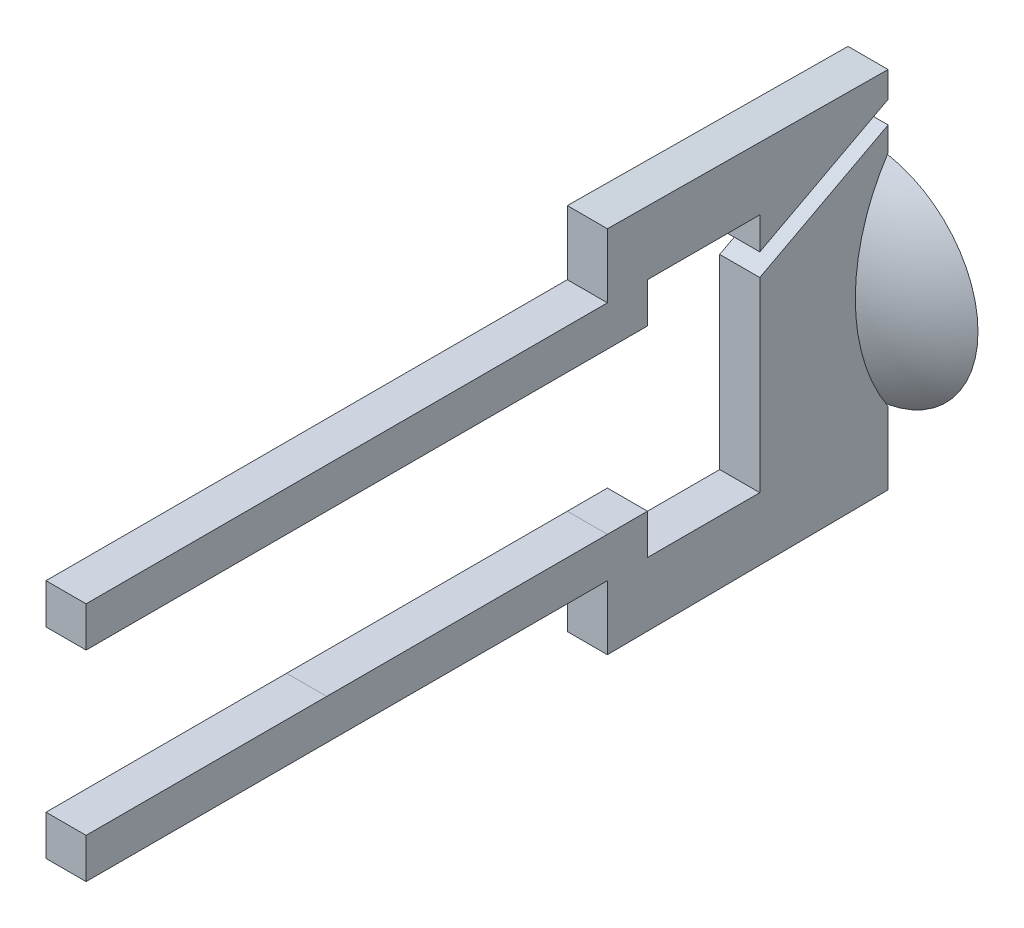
ISO-10303-21;
HEADER;
FILE_DESCRIPTION(('STEP AP214'),'2;1');
FILE_NAME('part.step','',(''),(''),'','','');
FILE_SCHEMA(('AUTOMOTIVE_DESIGN { 1 0 10303 214 1 1 1 1 }'));
ENDSEC;
DATA;
#1=APPLICATION_CONTEXT('core data for automotive mechanical design processes');
#2=APPLICATION_PROTOCOL_DEFINITION('international standard','automotive_design',2000,#1);
#3=PRODUCT_CONTEXT('',#1,'mechanical');
#4=PRODUCT('Part','Part','',(#3));
#5=PRODUCT_RELATED_PRODUCT_CATEGORY('part','',(#4));
#6=PRODUCT_DEFINITION_FORMATION('','',#4);
#7=PRODUCT_DEFINITION_CONTEXT('part definition',#1,'design');
#8=PRODUCT_DEFINITION('design','',#6,#7);
#9=PRODUCT_DEFINITION_SHAPE('','',#8);
#10=(LENGTH_UNIT() NAMED_UNIT(*) SI_UNIT(.MILLI.,.METRE.));
#11=(NAMED_UNIT(*) PLANE_ANGLE_UNIT() SI_UNIT($,.RADIAN.));
#12=(NAMED_UNIT(*) SI_UNIT($,.STERADIAN.) SOLID_ANGLE_UNIT());
#13=UNCERTAINTY_MEASURE_WITH_UNIT(LENGTH_MEASURE(1.E-05),#10,'distance_accuracy_value','');
#14=(GEOMETRIC_REPRESENTATION_CONTEXT(3) GLOBAL_UNCERTAINTY_ASSIGNED_CONTEXT((#13)) GLOBAL_UNIT_ASSIGNED_CONTEXT((#10,
#11,#12)) REPRESENTATION_CONTEXT('',''));
#15=CARTESIAN_POINT('',(0.,0.,0.));
#16=DIRECTION('',(0.,0.,1.));
#17=DIRECTION('',(1.,0.,0.));
#18=AXIS2_PLACEMENT_3D('',#15,#16,#17);
#19=CARTESIAN_POINT('',(0.25,2.392,6.499997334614));
#20=DIRECTION('',(1.,0.,0.));
#21=DIRECTION('',(0.,-1.,0.));
#22=AXIS2_PLACEMENT_3D('',#19,#20,#21);
#23=PLANE('',#22);
#24=DIRECTION('',(0.,1.,0.));
#25=VECTOR('',#24,1.);
#26=CARTESIAN_POINT('',(0.249999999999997,1.24999999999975,6.3));
#27=LINE('',#26,#25);
#28=CARTESIAN_POINT('',(0.249999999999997,0.999999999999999,6.3));
#29=VERTEX_POINT('',#28);
#30=CARTESIAN_POINT('',(0.25,1.49999999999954,6.3));
#31=VERTEX_POINT('',#30);
#32=EDGE_CURVE('P0_E80',#29,#31,#27,.T.);
#33=ORIENTED_EDGE('',*,*,#32,.F.);
#34=DIRECTION('',(0.,0.,1.));
#35=VECTOR('',#34,1.);
#36=CARTESIAN_POINT('',(0.249999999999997,0.999999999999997,4.8));
#37=LINE('',#36,#35);
#38=CARTESIAN_POINT('',(0.25,0.999999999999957,-0.699999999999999));
#39=VERTEX_POINT('',#38);
#40=EDGE_CURVE('P0_E73',#39,#29,#37,.T.);
#41=ORIENTED_EDGE('',*,*,#40,.F.);
#42=DIRECTION('',(0.,-1.,0.));
#43=VECTOR('',#42,1.);
#44=CARTESIAN_POINT('',(0.249999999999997,1.24999999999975,-0.699999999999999));
#45=LINE('',#44,#43);
#46=CARTESIAN_POINT('',(0.249999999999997,1.5,-0.700000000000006));
#47=VERTEX_POINT('',#46);
#48=EDGE_CURVE('P0_E107',#47,#39,#45,.T.);
#49=ORIENTED_EDGE('',*,*,#48,.F.);
#50=DIRECTION('',(0.,0.,1.));
#51=VECTOR('',#50,1.);
#52=CARTESIAN_POINT('',(0.25,1.5,-1.40000000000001));
#53=LINE('',#52,#51);
#54=CARTESIAN_POINT('',(0.249999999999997,1.49999999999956,-2.1));
#55=VERTEX_POINT('',#54);
#56=EDGE_CURVE('P0_E117',#55,#47,#53,.T.);
#57=ORIENTED_EDGE('',*,*,#56,.F.);
#58=DIRECTION('',(0.,1.,0.));
#59=VECTOR('',#58,1.);
#60=CARTESIAN_POINT('',(0.25,1.3,-2.1));
#61=LINE('',#60,#59);
#62=CARTESIAN_POINT('',(0.25,1.10000000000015,-2.10000000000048));
#63=VERTEX_POINT('',#62);
#64=EDGE_CURVE('P0_E121',#63,#55,#61,.T.);
#65=ORIENTED_EDGE('',*,*,#64,.F.);
#66=DIRECTION('',(0.,-0.468146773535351,0.883650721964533));
#67=VECTOR('',#66,1.);
#68=CARTESIAN_POINT('',(0.25,1.523794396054,-2.8999333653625));
#69=LINE('',#68,#67);
#70=CARTESIAN_POINT('',(0.25,1.94758879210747,-3.699866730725));
#71=VERTEX_POINT('',#70);
#72=EDGE_CURVE('P0_E125',#71,#63,#69,.T.);
#73=ORIENTED_EDGE('',*,*,#72,.F.);
#74=DIRECTION('',(0.,-1.,0.));
#75=VECTOR('',#74,1.);
#76=CARTESIAN_POINT('',(0.249999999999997,2.1085229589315,-3.699866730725));
#77=LINE('',#76,#75);
#78=CARTESIAN_POINT('',(0.249999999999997,2.26945712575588,-3.69986673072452));
#79=VERTEX_POINT('',#78);
#80=EDGE_CURVE('P0_E129',#79,#71,#77,.T.);
#81=ORIENTED_EDGE('',*,*,#80,.F.);
#82=DIRECTION('',(0.,-0.00872653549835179,-0.999961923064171));
#83=VECTOR('',#82,1.);
#84=CARTESIAN_POINT('',(0.249999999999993,2.284728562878,-1.94993336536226));
#85=LINE('',#84,#83);
#86=CARTESIAN_POINT('',(0.25,2.3,-0.200000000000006));
#87=VERTEX_POINT('',#86);
#88=EDGE_CURVE('P0_E133',#87,#79,#85,.T.);
#89=ORIENTED_EDGE('',*,*,#88,.F.);
#90=DIRECTION('',(0.,1.,0.));
#91=VECTOR('',#90,1.);
#92=CARTESIAN_POINT('',(0.25,1.9,-0.200000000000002));
#93=LINE('',#92,#91);
#94=CARTESIAN_POINT('',(0.249999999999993,1.5,-0.200000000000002));
#95=VERTEX_POINT('',#94);
#96=EDGE_CURVE('P0_E137',#95,#87,#93,.T.);
#97=ORIENTED_EDGE('',*,*,#96,.F.);
#98=DIRECTION('',(0.,0.,-1.));
#99=VECTOR('',#98,1.);
#100=CARTESIAN_POINT('',(0.25,1.5,4.8));
#101=LINE('',#100,#99);
#102=EDGE_CURVE('P0_E144',#31,#95,#101,.T.);
#103=ORIENTED_EDGE('',*,*,#102,.F.);
#104=EDGE_LOOP('',(#33,#41,#49,#57,#65,#73,#81,#89,#97,#103));
#105=FACE_BOUND('',#104,.T.);
#106=ADVANCED_FACE('P0_F16',(#105),#23,.T.);
#107=CARTESIAN_POINT('',(-0.264307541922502,0.985692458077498,-0.700000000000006));
#108=DIRECTION('',(0.,0.,-1.));
#109=DIRECTION('',(0.,1.,0.));
#110=AXIS2_PLACEMENT_3D('',#107,#108,#109);
#111=PLANE('',#110);
#112=ORIENTED_EDGE('',*,*,#48,.T.);
#113=DIRECTION('',(-1.,0.,0.));
#114=VECTOR('',#113,1.);
#115=CARTESIAN_POINT('',(0.,0.999999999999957,-0.699999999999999));
#116=LINE('',#115,#114);
#117=CARTESIAN_POINT('',(-0.25,0.999999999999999,-0.700000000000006));
#118=VERTEX_POINT('',#117);
#119=EDGE_CURVE('P0_E114',#39,#118,#116,.T.);
#120=ORIENTED_EDGE('',*,*,#119,.T.);
#121=DIRECTION('',(0.,1.,0.));
#122=VECTOR('',#121,1.);
#123=CARTESIAN_POINT('',(-0.250000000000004,0.,-0.700000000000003));
#124=LINE('',#123,#122);
#125=CARTESIAN_POINT('',(-0.25,1.5,-0.699999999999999));
#126=VERTEX_POINT('',#125);
#127=EDGE_CURVE('P0_E228',#118,#126,#124,.T.);
#128=ORIENTED_EDGE('',*,*,#127,.T.);
#129=DIRECTION('',(-1.,0.,0.));
#130=VECTOR('',#129,1.);
#131=CARTESIAN_POINT('',(0.,1.5,-0.699999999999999));
#132=LINE('',#131,#130);
#133=EDGE_CURVE('P0_E65',#47,#126,#132,.T.);
#134=ORIENTED_EDGE('',*,*,#133,.F.);
#135=EDGE_LOOP('',(#112,#120,#128,#134));
#136=FACE_BOUND('',#135,.T.);
#137=ADVANCED_FACE('P0_F112',(#136),#111,.T.);
#138=CARTESIAN_POINT('',(-0.264307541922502,1.5,-0.672000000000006));
#139=DIRECTION('',(0.,-1.,0.));
#140=DIRECTION('',(0.,0.,-1.));
#141=AXIS2_PLACEMENT_3D('',#138,#139,#140);
#142=PLANE('',#141);
#143=ORIENTED_EDGE('',*,*,#56,.T.);
#144=ORIENTED_EDGE('',*,*,#133,.T.);
#145=DIRECTION('',(0.,0.,-1.));
#146=VECTOR('',#145,1.);
#147=CARTESIAN_POINT('',(-0.25,1.5,1.30006663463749));
#148=LINE('',#147,#146);
#149=CARTESIAN_POINT('',(-0.249999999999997,1.5,-2.1));
#150=VERTEX_POINT('',#149);
#151=EDGE_CURVE('P0_E227',#126,#150,#148,.T.);
#152=ORIENTED_EDGE('',*,*,#151,.T.);
#153=DIRECTION('',(-1.,0.,0.));
#154=VECTOR('',#153,1.);
#155=CARTESIAN_POINT('',(0.,1.49999999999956,-2.1));
#156=LINE('',#155,#154);
#157=EDGE_CURVE('P0_E123',#55,#150,#156,.T.);
#158=ORIENTED_EDGE('',*,*,#157,.F.);
#159=EDGE_LOOP('',(#143,#144,#152,#158));
#160=FACE_BOUND('',#159,.T.);
#161=ADVANCED_FACE('P0_F177',(#160),#142,.T.);
#162=CARTESIAN_POINT('',(-0.264307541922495,1.514307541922,-2.1));
#163=DIRECTION('',(0.,0.,1.));
#164=DIRECTION('',(0.,-1.,0.));
#165=AXIS2_PLACEMENT_3D('',#162,#163,#164);
#166=PLANE('',#165);
#167=ORIENTED_EDGE('',*,*,#64,.T.);
#168=ORIENTED_EDGE('',*,*,#157,.T.);
#169=DIRECTION('',(0.,-1.,0.));
#170=VECTOR('',#169,1.);
#171=CARTESIAN_POINT('',(-0.25,0.,-2.1));
#172=LINE('',#171,#170);
#173=CARTESIAN_POINT('',(-0.25,1.1,-2.1));
#174=VERTEX_POINT('',#173);
#175=EDGE_CURVE('P0_E155',#150,#174,#172,.T.);
#176=ORIENTED_EDGE('',*,*,#175,.T.);
#177=DIRECTION('',(-1.,0.,0.));
#178=VECTOR('',#177,1.);
#179=CARTESIAN_POINT('',(0.,1.10000000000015,-2.10000000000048));
#180=LINE('',#179,#178);
#181=EDGE_CURVE('P0_E127',#63,#174,#180,.T.);
#182=ORIENTED_EDGE('',*,*,#181,.F.);
#183=EDGE_LOOP('',(#167,#168,#176,#182));
#184=FACE_BOUND('',#183,.T.);
#185=ADVANCED_FACE('P0_F180',(#184),#166,.T.);
#186=CARTESIAN_POINT('',(-0.264307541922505,1.083048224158,-2.06800266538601));
#187=DIRECTION('',(0.,-0.883650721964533,-0.468146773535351));
#188=DIRECTION('',(0.,0.468146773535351,-0.883650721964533));
#189=AXIS2_PLACEMENT_3D('',#186,#187,#188);
#190=PLANE('',#189);
#191=ORIENTED_EDGE('',*,*,#72,.T.);
#192=ORIENTED_EDGE('',*,*,#181,.T.);
#193=CARTESIAN_POINT('',(-0.250000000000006,1.1,-2.1));
#194=CARTESIAN_POINT('',(-0.250000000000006,1.13531619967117,-2.16666111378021));
#195=CARTESIAN_POINT('',(-0.250000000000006,1.17063239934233,-2.23332222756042));
#196=CARTESIAN_POINT('',(-0.250000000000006,1.24126479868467,-2.36664445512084));
#197=CARTESIAN_POINT('',(-0.250000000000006,1.27658099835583,-2.43330556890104));
#198=CARTESIAN_POINT('',(-0.250000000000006,1.34721339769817,-2.56662779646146));
#199=CARTESIAN_POINT('',(-0.250000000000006,1.38252959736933,-2.63328891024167));
#200=CARTESIAN_POINT('',(-0.250000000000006,1.45316199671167,-2.76661113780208));
#201=CARTESIAN_POINT('',(-0.250000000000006,1.48847819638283,-2.83327225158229));
#202=CARTESIAN_POINT('',(-0.250000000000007,1.55911059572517,-2.96659447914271));
#203=CARTESIAN_POINT('',(-0.250000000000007,1.59442679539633,-3.03325559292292));
#204=CARTESIAN_POINT('',(-0.250000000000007,1.66505919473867,-3.16657782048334));
#205=CARTESIAN_POINT('',(-0.250000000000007,1.70037539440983,-3.23323893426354));
#206=CARTESIAN_POINT('',(-0.250000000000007,1.77100779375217,-3.36656116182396));
#207=CARTESIAN_POINT('',(-0.250000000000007,1.80632399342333,-3.43322227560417));
#208=CARTESIAN_POINT('',(-0.250000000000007,1.87695639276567,-3.56654450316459));
#209=CARTESIAN_POINT('',(-0.250000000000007,1.91227259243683,-3.63320561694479));
#210=CARTESIAN_POINT('',(-0.250000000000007,1.947588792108,-3.699866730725));
#211=B_SPLINE_CURVE_WITH_KNOTS('',3,(#193,#194,#195,#196,#197,#198,#199,#200,#201,#202,#203,
#204,#205,#206,#207,#208,#209,#210),.UNSPECIFIED.,.F.,.F.,(4,2,2,2,2,2,2,2,4),(0.,
0.226314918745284,0.452629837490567,0.67894475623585,0.905259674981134,1.13157459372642,
1.3578895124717,1.58420443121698,1.81051934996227),.UNSPECIFIED.);
#212=CARTESIAN_POINT('',(-0.25,1.947588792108,-3.699866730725));
#213=VERTEX_POINT('',#212);
#214=EDGE_CURVE('P0_E149',#174,#213,#211,.T.);
#215=ORIENTED_EDGE('',*,*,#214,.T.);
#216=DIRECTION('',(-1.,0.,0.));
#217=VECTOR('',#216,1.);
#218=CARTESIAN_POINT('',(0.,1.94758879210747,-3.69986673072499));
#219=LINE('',#218,#217);
#220=EDGE_CURVE('P0_E131',#71,#213,#219,.T.);
#221=ORIENTED_EDGE('',*,*,#220,.F.);
#222=EDGE_LOOP('',(#191,#192,#215,#221));
#223=FACE_BOUND('',#222,.T.);
#224=ADVANCED_FACE('P0_F183',(#223),#190,.T.);
#225=CARTESIAN_POINT('',(-0.264307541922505,1.933281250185,-3.699866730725));
#226=DIRECTION('',(0.,0.,-1.));
#227=DIRECTION('',(0.,1.,0.));
#228=AXIS2_PLACEMENT_3D('',#225,#226,#227);
#229=PLANE('',#228);
#230=ORIENTED_EDGE('',*,*,#80,.T.);
#231=ORIENTED_EDGE('',*,*,#220,.T.);
#232=DIRECTION('',(0.,1.,0.));
#233=VECTOR('',#232,1.);
#234=CARTESIAN_POINT('',(-0.25,0.,-3.699866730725));
#235=LINE('',#234,#233);
#236=CARTESIAN_POINT('',(-0.25,2.269457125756,-3.699866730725));
#237=VERTEX_POINT('',#236);
#238=EDGE_CURVE('P0_E154',#213,#237,#235,.T.);
#239=ORIENTED_EDGE('',*,*,#238,.T.);
#240=DIRECTION('',(-1.,0.,0.));
#241=VECTOR('',#240,1.);
#242=CARTESIAN_POINT('',(0.,2.26945712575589,-3.69986673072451));
#243=LINE('',#242,#241);
#244=EDGE_CURVE('P0_E135',#79,#237,#243,.T.);
#245=ORIENTED_EDGE('',*,*,#244,.F.);
#246=EDGE_LOOP('',(#230,#231,#239,#245));
#247=FACE_BOUND('',#246,.T.);
#248=ADVANCED_FACE('P0_F187',(#247),#229,.T.);
#249=CARTESIAN_POINT('',(-0.264307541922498,2.268846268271,-3.769864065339));
#250=DIRECTION('',(0.,0.999961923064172,-0.00872653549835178));
#251=DIRECTION('',(0.,0.0087265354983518,0.999961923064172));
#252=AXIS2_PLACEMENT_3D('',#249,#250,#251);
#253=PLANE('',#252);
#254=ORIENTED_EDGE('',*,*,#88,.T.);
#255=ORIENTED_EDGE('',*,*,#244,.T.);
#256=CARTESIAN_POINT('',(-0.250000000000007,2.269457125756,-3.699866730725));
#257=CARTESIAN_POINT('',(-0.250000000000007,2.27072974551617,-3.55403895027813));
#258=CARTESIAN_POINT('',(-0.250000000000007,2.27200236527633,-3.40821116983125));
#259=CARTESIAN_POINT('',(-0.250000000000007,2.27454760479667,-3.1165556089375));
#260=CARTESIAN_POINT('',(-0.250000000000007,2.27582022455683,-2.97072782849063));
#261=CARTESIAN_POINT('',(-0.250000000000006,2.27836546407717,-2.67907226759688));
#262=CARTESIAN_POINT('',(-0.250000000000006,2.27963808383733,-2.53324448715));
#263=CARTESIAN_POINT('',(-0.250000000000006,2.28218332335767,-2.24158892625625));
#264=CARTESIAN_POINT('',(-0.250000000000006,2.28345594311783,-2.09576114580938));
#265=CARTESIAN_POINT('',(-0.250000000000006,2.28600118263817,-1.80410558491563));
#266=CARTESIAN_POINT('',(-0.250000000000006,2.28727380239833,-1.65827780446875));
#267=CARTESIAN_POINT('',(-0.250000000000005,2.28981904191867,-1.366622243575));
#268=CARTESIAN_POINT('',(-0.250000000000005,2.29109166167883,-1.22079446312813));
#269=CARTESIAN_POINT('',(-0.250000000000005,2.29363690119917,-0.929138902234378));
#270=CARTESIAN_POINT('',(-0.250000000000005,2.29490952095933,-0.783311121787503));
#271=CARTESIAN_POINT('',(-0.250000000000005,2.29745476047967,-0.491655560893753));
#272=CARTESIAN_POINT('',(-0.250000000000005,2.29872738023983,-0.345827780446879));
#273=CARTESIAN_POINT('',(-0.250000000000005,2.3,-0.200000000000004));
#274=B_SPLINE_CURVE_WITH_KNOTS('',3,(#256,#257,#258,#259,#260,#261,#262,#263,#264,#265,#266,
#267,#268,#269,#270,#271,#272,#273),.UNSPECIFIED.,.F.,.F.,(4,2,2,2,2,2,2,2,4),(0.,
0.43750000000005,0.875000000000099,1.31250000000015,1.7500000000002,2.18750000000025,
2.6250000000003,3.06250000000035,3.5000000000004),.UNSPECIFIED.);
#275=CARTESIAN_POINT('',(-0.25,2.3,-0.200000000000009));
#276=VERTEX_POINT('',#275);
#277=EDGE_CURVE('P0_E156',#237,#276,#274,.T.);
#278=ORIENTED_EDGE('',*,*,#277,.T.);
#279=DIRECTION('',(-1.,0.,0.));
#280=VECTOR('',#279,1.);
#281=CARTESIAN_POINT('',(0.,2.3,-0.199999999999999));
#282=LINE('',#281,#280);
#283=EDGE_CURVE('P0_E139',#87,#276,#282,.T.);
#284=ORIENTED_EDGE('',*,*,#283,.F.);
#285=EDGE_LOOP('',(#254,#255,#278,#284));
#286=FACE_BOUND('',#285,.T.);
#287=ADVANCED_FACE('P0_F191',(#286),#253,.T.);
#288=CARTESIAN_POINT('',(-0.264307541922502,2.316,-0.200000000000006));
#289=DIRECTION('',(0.,0.,1.));
#290=DIRECTION('',(0.,-1.,0.));
#291=AXIS2_PLACEMENT_3D('',#288,#289,#290);
#292=PLANE('',#291);
#293=ORIENTED_EDGE('',*,*,#96,.T.);
#294=ORIENTED_EDGE('',*,*,#283,.T.);
#295=DIRECTION('',(0.,-1.,0.));
#296=VECTOR('',#295,1.);
#297=CARTESIAN_POINT('',(-0.25,0.,-0.200000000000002));
#298=LINE('',#297,#296);
#299=CARTESIAN_POINT('',(-0.250000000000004,1.5,-0.200000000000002));
#300=VERTEX_POINT('',#299);
#301=EDGE_CURVE('P0_E219',#276,#300,#298,.T.);
#302=ORIENTED_EDGE('',*,*,#301,.T.);
#303=DIRECTION('',(-1.,0.,0.));
#304=VECTOR('',#303,1.);
#305=CARTESIAN_POINT('',(0.,1.5,-0.200000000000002));
#306=LINE('',#305,#304);
#307=EDGE_CURVE('P0_E141',#95,#300,#306,.T.);
#308=ORIENTED_EDGE('',*,*,#307,.F.);
#309=EDGE_LOOP('',(#293,#294,#302,#308));
#310=FACE_BOUND('',#309,.T.);
#311=ADVANCED_FACE('P0_F195',(#310),#292,.T.);
#312=CARTESIAN_POINT('',(-0.264307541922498,1.5,3.24));
#313=DIRECTION('',(0.,1.,0.));
#314=DIRECTION('',(0.,0.,1.));
#315=AXIS2_PLACEMENT_3D('',#312,#313,#314);
#316=PLANE('',#315);
#317=ORIENTED_EDGE('',*,*,#102,.T.);
#318=ORIENTED_EDGE('',*,*,#307,.T.);
#319=DIRECTION('',(0.,0.,1.));
#320=VECTOR('',#319,1.);
#321=CARTESIAN_POINT('',(-0.25,1.5,1.30006663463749));
#322=LINE('',#321,#320);
#323=CARTESIAN_POINT('',(-0.25,1.5,6.3));
#324=VERTEX_POINT('',#323);
#325=EDGE_CURVE('P0_E26',#300,#324,#322,.T.);
#326=ORIENTED_EDGE('',*,*,#325,.T.);
#327=DIRECTION('',(-1.,0.,0.));
#328=VECTOR('',#327,1.);
#329=CARTESIAN_POINT('',(0.,1.49999999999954,6.3));
#330=LINE('',#329,#328);
#331=EDGE_CURVE('P0_E109',#31,#324,#330,.T.);
#332=ORIENTED_EDGE('',*,*,#331,.F.);
#333=EDGE_LOOP('',(#317,#318,#326,#332));
#334=FACE_BOUND('',#333,.T.);
#335=ADVANCED_FACE('P0_F199',(#334),#316,.T.);
#336=CARTESIAN_POINT('',(-0.264307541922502,1.514307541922,6.3));
#337=DIRECTION('',(0.,0.,1.));
#338=DIRECTION('',(0.,-1.,0.));
#339=AXIS2_PLACEMENT_3D('',#336,#337,#338);
#340=PLANE('',#339);
#341=ORIENTED_EDGE('',*,*,#32,.T.);
#342=ORIENTED_EDGE('',*,*,#331,.T.);
#343=DIRECTION('',(0.,-1.,0.));
#344=VECTOR('',#343,1.);
#345=CARTESIAN_POINT('',(-0.25,0.,6.29999999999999));
#346=LINE('',#345,#344);
#347=CARTESIAN_POINT('',(-0.249999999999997,0.999999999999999,6.3));
#348=VERTEX_POINT('',#347);
#349=EDGE_CURVE('P0_E11',#324,#348,#346,.T.);
#350=ORIENTED_EDGE('',*,*,#349,.T.);
#351=DIRECTION('',(-1.,0.,0.));
#352=VECTOR('',#351,1.);
#353=CARTESIAN_POINT('',(0.,0.999999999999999,6.3));
#354=LINE('',#353,#352);
#355=EDGE_CURVE('P0_E108',#29,#348,#354,.T.);
#356=ORIENTED_EDGE('',*,*,#355,.F.);
#357=EDGE_LOOP('',(#341,#342,#350,#356));
#358=FACE_BOUND('',#357,.T.);
#359=ADVANCED_FACE('P0_F203',(#358),#340,.T.);
#360=CARTESIAN_POINT('',(-0.264307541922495,1.,6.36));
#361=DIRECTION('',(0.,-1.,0.));
#362=DIRECTION('',(0.,0.,-1.));
#363=AXIS2_PLACEMENT_3D('',#360,#361,#362);
#364=PLANE('',#363);
#365=ORIENTED_EDGE('',*,*,#40,.T.);
#366=ORIENTED_EDGE('',*,*,#355,.T.);
#367=DIRECTION('',(0.,0.,-1.));
#368=VECTOR('',#367,1.);
#369=CARTESIAN_POINT('',(-0.250000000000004,0.999999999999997,1.3000666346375));
#370=LINE('',#369,#368);
#371=EDGE_CURVE('P0_E20',#348,#118,#370,.T.);
#372=ORIENTED_EDGE('',*,*,#371,.T.);
#373=ORIENTED_EDGE('',*,*,#119,.F.);
#374=EDGE_LOOP('',(#365,#366,#372,#373));
#375=FACE_BOUND('',#374,.T.);
#376=ADVANCED_FACE('P0_F116',(#375),#364,.T.);
#377=CARTESIAN_POINT('',(-0.25,2.392,6.49999733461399));
#378=DIRECTION('',(1.,0.,0.));
#379=DIRECTION('',(0.,-1.,0.));
#380=AXIS2_PLACEMENT_3D('',#377,#378,#379);
#381=PLANE('',#380);
#382=ORIENTED_EDGE('',*,*,#349,.F.);
#383=ORIENTED_EDGE('',*,*,#325,.F.);
#384=ORIENTED_EDGE('',*,*,#301,.F.);
#385=ORIENTED_EDGE('',*,*,#277,.F.);
#386=ORIENTED_EDGE('',*,*,#238,.F.);
#387=ORIENTED_EDGE('',*,*,#214,.F.);
#388=ORIENTED_EDGE('',*,*,#175,.F.);
#389=ORIENTED_EDGE('',*,*,#151,.F.);
#390=ORIENTED_EDGE('',*,*,#127,.F.);
#391=ORIENTED_EDGE('',*,*,#371,.F.);
#392=EDGE_LOOP('',(#382,#383,#384,#385,#386,#387,#388,#389,#390,#391));
#393=FACE_BOUND('',#392,.T.);
#394=ADVANCED_FACE('P0_F18',(#393),#381,.F.);
#395=CLOSED_SHELL('',(#106,#137,#161,#185,#224,#248,#287,#311,#335,#359,#376,#394));
#396=MANIFOLD_SOLID_BREP('P0_B1',#395);
#397=CARTESIAN_POINT('',(-0.264307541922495,-1.,3.24));
#398=CARTESIAN_POINT('',(0.264307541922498,-1.,3.24));
#399=CARTESIAN_POINT('',(-0.264307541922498,-1.,6.35999999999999));
#400=CARTESIAN_POINT('',(0.264307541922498,-1.,6.35999999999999));
#401=B_SPLINE_SURFACE_WITH_KNOTS('',1,1,((#397,#398),(#399,#400)),.UNSPECIFIED.,.F.,.F.,.F.,(2,
2),(2,2),(-0.06,3.06),(-0.01430754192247,0.5143075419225),.UNSPECIFIED.);
#402=DIRECTION('',(0.,0.,-1.));
#403=VECTOR('',#402,1.);
#404=CARTESIAN_POINT('',(0.25,-1.,4.8));
#405=LINE('',#404,#403);
#406=CARTESIAN_POINT('',(0.25,-1.,6.3));
#407=VERTEX_POINT('',#406);
#408=CARTESIAN_POINT('',(0.25,-1.,3.3));
#409=VERTEX_POINT('',#408);
#410=EDGE_CURVE('P1_E27',#407,#409,#405,.T.);
#411=DIRECTION('',(-1.,0.,0.));
#412=VECTOR('',#411,1.);
#413=CARTESIAN_POINT('',(0.,-1.,3.3));
#414=LINE('',#413,#412);
#415=CARTESIAN_POINT('',(-0.250000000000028,-1.,3.3));
#416=VERTEX_POINT('',#415);
#417=EDGE_CURVE('P1_E11',#409,#416,#414,.T.);
#418=DIRECTION('',(0.,0.,1.));
#419=VECTOR('',#418,1.);
#420=CARTESIAN_POINT('',(-0.250000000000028,-1.,4.79999999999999));
#421=LINE('',#420,#419);
#422=CARTESIAN_POINT('',(-0.250000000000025,-1.,6.3));
#423=VERTEX_POINT('',#422);
#424=EDGE_CURVE('P1_E191',#416,#423,#421,.T.);
#425=DIRECTION('',(1.,0.,0.));
#426=VECTOR('',#425,1.);
#427=CARTESIAN_POINT('',(0.,-1.,6.3));
#428=LINE('',#427,#426);
#429=EDGE_CURVE('P1_E296',#423,#407,#428,.T.);
#430=ORIENTED_EDGE('',*,*,#410,.T.);
#431=ORIENTED_EDGE('',*,*,#417,.T.);
#432=ORIENTED_EDGE('',*,*,#424,.T.);
#433=ORIENTED_EDGE('',*,*,#429,.T.);
#434=EDGE_LOOP('',(#430,#431,#432,#433));
#435=FACE_BOUND('',#434,.T.);
#436=ADVANCED_FACE('P1_F16',(#435),#401,.T.);
#437=CARTESIAN_POINT('',(-0.264307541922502,-1.,-0.270000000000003));
#438=CARTESIAN_POINT('',(0.264307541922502,-1.,-0.270000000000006));
#439=CARTESIAN_POINT('',(-0.264307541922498,-1.,3.37));
#440=CARTESIAN_POINT('',(0.264307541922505,-1.,3.37));
#441=B_SPLINE_SURFACE_WITH_KNOTS('',1,1,((#437,#438),(#439,#440)),.UNSPECIFIED.,.F.,.F.,.F.,(2,
2),(2,2),(-0.07,3.57),(-0.01430754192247,0.5143075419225),.UNSPECIFIED.);
#442=DIRECTION('',(0.,0.,-1.));
#443=VECTOR('',#442,1.);
#444=CARTESIAN_POINT('',(0.250000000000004,-1.,1.55));
#445=LINE('',#444,#443);
#446=CARTESIAN_POINT('',(0.249999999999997,-1.,-0.200000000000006));
#447=VERTEX_POINT('',#446);
#448=EDGE_CURVE('P1_E192',#409,#447,#445,.T.);
#449=DIRECTION('',(-1.,0.,0.));
#450=VECTOR('',#449,1.);
#451=CARTESIAN_POINT('',(0.,-1.,-0.200000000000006));
#452=LINE('',#451,#450);
#453=CARTESIAN_POINT('',(-0.250000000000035,-1.,-0.200000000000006));
#454=VERTEX_POINT('',#453);
#455=EDGE_CURVE('P1_E187',#447,#454,#452,.T.);
#456=DIRECTION('',(0.,0.,1.));
#457=VECTOR('',#456,1.);
#458=CARTESIAN_POINT('',(-0.250000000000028,-1.,1.55));
#459=LINE('',#458,#457);
#460=EDGE_CURVE('P1_E196',#454,#416,#459,.T.);
#461=ORIENTED_EDGE('',*,*,#448,.T.);
#462=ORIENTED_EDGE('',*,*,#455,.T.);
#463=ORIENTED_EDGE('',*,*,#460,.T.);
#464=ORIENTED_EDGE('',*,*,#417,.F.);
#465=EDGE_LOOP('',(#461,#462,#463,#464));
#466=FACE_BOUND('',#465,.T.);
#467=ADVANCED_FACE('P1_F220',(#466),#441,.T.);
#468=CARTESIAN_POINT('',(0.25,2.392,6.499997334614));
#469=CARTESIAN_POINT('',(0.25,2.392,-3.899864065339));
#470=CARTESIAN_POINT('',(0.25,-2.392,6.499997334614));
#471=CARTESIAN_POINT('',(0.249999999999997,-2.392,-3.899864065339));
#472=B_SPLINE_SURFACE_WITH_KNOTS('',1,1,((#468,#469),(#470,#471)),.UNSPECIFIED.,.F.,.F.,.F.,(2,
2),(2,2),(-2.392,2.392),(-3.199997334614,7.199864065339),.UNSPECIFIED.);
#473=DIRECTION('',(0.,0.,1.));
#474=VECTOR('',#473,1.);
#475=CARTESIAN_POINT('',(0.25,-1.,1.3000666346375));
#476=LINE('',#475,#474);
#477=CARTESIAN_POINT('',(0.25,-1.,-0.700000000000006));
#478=VERTEX_POINT('',#477);
#479=EDGE_CURVE('P1_E199',#478,#447,#476,.T.);
#480=DIRECTION('',(0.,-1.,0.));
#481=VECTOR('',#480,1.);
#482=CARTESIAN_POINT('',(0.250000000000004,0.,6.3));
#483=LINE('',#482,#481);
#484=CARTESIAN_POINT('',(0.25,-1.49999999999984,6.3));
#485=VERTEX_POINT('',#484);
#486=EDGE_CURVE('P1_E279',#407,#485,#483,.T.);
#487=DIRECTION('',(0.,0.,-1.));
#488=VECTOR('',#487,1.);
#489=CARTESIAN_POINT('',(0.25,-1.5,1.30006663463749));
#490=LINE('',#489,#488);
#491=CARTESIAN_POINT('',(0.25,-1.5,3.3));
#492=VERTEX_POINT('',#491);
#493=EDGE_CURVE('P1_E269',#485,#492,#490,.T.);
#494=DIRECTION('',(0.,0.,-1.));
#495=VECTOR('',#494,1.);
#496=CARTESIAN_POINT('',(0.25,-1.5,1.30006663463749));
#497=LINE('',#496,#495);
#498=CARTESIAN_POINT('',(0.249999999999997,-1.5,-0.200000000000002));
#499=VERTEX_POINT('',#498);
#500=EDGE_CURVE('P1_E257',#492,#499,#497,.T.);
#501=DIRECTION('',(0.,-1.,0.));
#502=VECTOR('',#501,1.);
#503=CARTESIAN_POINT('',(0.25,0.,-0.200000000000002));
#504=LINE('',#503,#502);
#505=CARTESIAN_POINT('',(0.250000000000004,-2.30000000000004,-0.200000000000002));
#506=VERTEX_POINT('',#505);
#507=EDGE_CURVE('P1_E253',#499,#506,#504,.T.);
#508=CARTESIAN_POINT('',(0.249999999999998,-2.3,-0.200000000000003));
#509=CARTESIAN_POINT('',(0.249999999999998,-2.29872738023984,-0.345827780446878));
#510=CARTESIAN_POINT('',(0.249999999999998,-2.29745476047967,-0.491655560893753));
#511=CARTESIAN_POINT('',(0.249999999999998,-2.29490952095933,-0.783311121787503));
#512=CARTESIAN_POINT('',(0.249999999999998,-2.29363690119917,-0.929138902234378));
#513=CARTESIAN_POINT('',(0.249999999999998,-2.29109166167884,-1.22079446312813));
#514=CARTESIAN_POINT('',(0.249999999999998,-2.28981904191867,-1.366622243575));
#515=CARTESIAN_POINT('',(0.249999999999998,-2.28727380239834,-1.65827780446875));
#516=CARTESIAN_POINT('',(0.249999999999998,-2.28600118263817,-1.80410558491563));
#517=CARTESIAN_POINT('',(0.249999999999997,-2.28345594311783,-2.09576114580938));
#518=CARTESIAN_POINT('',(0.249999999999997,-2.28218332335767,-2.24158892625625));
#519=CARTESIAN_POINT('',(0.249999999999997,-2.27963808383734,-2.53324448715));
#520=CARTESIAN_POINT('',(0.249999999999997,-2.27836546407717,-2.67907226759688));
#521=CARTESIAN_POINT('',(0.249999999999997,-2.27582022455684,-2.97072782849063));
#522=CARTESIAN_POINT('',(0.249999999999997,-2.27454760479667,-3.1165556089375));
#523=CARTESIAN_POINT('',(0.249999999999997,-2.27200236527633,-3.40821116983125));
#524=CARTESIAN_POINT('',(0.249999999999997,-2.27072974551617,-3.55403895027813));
#525=CARTESIAN_POINT('',(0.249999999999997,-2.269457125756,-3.699866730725));
#526=B_SPLINE_CURVE_WITH_KNOTS('',3,(#508,#509,#510,#511,#512,#513,#514,#515,#516,#517,#518,
#519,#520,#521,#522,#523,#524,#525),.UNSPECIFIED.,.F.,.F.,(4,2,2,2,2,2,2,2,4),(0.,
0.43750000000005,0.8750000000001,1.31250000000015,1.7500000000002,2.18750000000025,
2.6250000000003,3.06250000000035,3.5000000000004),.UNSPECIFIED.);
#527=CARTESIAN_POINT('',(0.249999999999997,-2.269457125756,-3.699866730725));
#528=VERTEX_POINT('',#527);
#529=EDGE_CURVE('P1_E184',#506,#528,#526,.T.);
#530=DIRECTION('',(0.,1.,0.));
#531=VECTOR('',#530,1.);
#532=CARTESIAN_POINT('',(0.250000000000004,0.,-3.699866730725));
#533=LINE('',#532,#531);
#534=CARTESIAN_POINT('',(0.25,-1.37075562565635,-3.69986673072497));
#535=VERTEX_POINT('',#534);
#536=EDGE_CURVE('P1_E176',#528,#535,#533,.T.);
#537=CARTESIAN_POINT('',(0.249999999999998,-1.370755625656,-3.699866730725));
#538=CARTESIAN_POINT('',(0.249999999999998,-1.35631777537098,-3.6903839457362));
#539=CARTESIAN_POINT('',(0.249999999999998,-1.34177980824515,-3.68105365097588));
#540=CARTESIAN_POINT('',(0.249999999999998,-1.31251158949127,-3.66270140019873));
#541=CARTESIAN_POINT('',(0.249999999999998,-1.29778134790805,-3.65367942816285));
#542=CARTESIAN_POINT('',(0.249999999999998,-1.2681355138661,-3.63594648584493));
#543=CARTESIAN_POINT('',(0.249999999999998,-1.25321992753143,-3.62723550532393));
#544=CARTESIAN_POINT('',(0.249999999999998,-1.22321032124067,-3.61012719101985));
#545=CARTESIAN_POINT('',(0.249999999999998,-1.20811630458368,-3.60172985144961));
#546=CARTESIAN_POINT('',(0.249999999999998,-1.17775675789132,-3.58525147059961));
#547=CARTESIAN_POINT('',(0.249999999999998,-1.16249122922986,-3.57717042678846));
#548=CARTESIAN_POINT('',(0.249999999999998,-1.13179557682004,-3.56132728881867));
#549=CARTESIAN_POINT('',(0.249999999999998,-1.11636545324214,-3.55356519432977));
#550=CARTESIAN_POINT('',(0.249999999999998,-1.08534752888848,-3.53836260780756));
#551=CARTESIAN_POINT('',(0.249999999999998,-1.06975972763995,-3.53092211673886));
#552=CARTESIAN_POINT('',(0.249999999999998,-1.03843336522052,-3.51636539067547));
#553=CARTESIAN_POINT('',(0.249999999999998,-1.02269480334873,-3.50924915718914));
#554=CARTESIAN_POINT('',(0.249999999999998,-0.991073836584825,-3.49534360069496));
#555=CARTESIAN_POINT('',(0.249999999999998,-0.97519143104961,-3.48855427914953));
#556=CARTESIAN_POINT('',(0.249999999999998,-0.943289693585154,-3.47530520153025));
#557=CARTESIAN_POINT('',(0.249999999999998,-0.927270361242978,-3.4688454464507));
#558=CARTESIAN_POINT('',(0.249999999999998,-0.895101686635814,-3.45625815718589));
#559=CARTESIAN_POINT('',(0.249999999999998,-0.878952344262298,-3.45013062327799));
#560=CARTESIAN_POINT('',(0.249999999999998,-0.846530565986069,-3.43821043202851));
#561=CARTESIAN_POINT('',(0.249999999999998,-0.830258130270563,-3.43241777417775));
#562=CARTESIAN_POINT('',(0.249999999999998,-0.79759708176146,-3.42116999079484));
#563=CARTESIAN_POINT('',(0.249999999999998,-0.781208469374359,-3.41571486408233));
#564=CARTESIAN_POINT('',(0.249999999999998,-0.748321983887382,-3.40514479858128));
#565=CARTESIAN_POINT('',(0.249999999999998,-0.731824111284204,-3.40002985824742));
#566=CARTESIAN_POINT('',(0.249999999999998,-0.6987260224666,-3.39014282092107));
#567=CARTESIAN_POINT('',(0.249999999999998,-0.682125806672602,-3.3853707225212));
#568=CARTESIAN_POINT('',(0.249999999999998,-0.648829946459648,-3.37617202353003));
#569=CARTESIAN_POINT('',(0.249999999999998,-0.632134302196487,-3.37174542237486));
#570=CARTESIAN_POINT('',(0.249999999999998,-0.598654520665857,-3.36324037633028));
#571=CARTESIAN_POINT('',(0.249999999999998,-0.581870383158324,-3.35916193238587));
#572=CARTESIAN_POINT('',(0.249999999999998,-0.548220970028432,-3.3513543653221));
#573=CARTESIAN_POINT('',(0.249999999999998,-0.531355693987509,-3.34762524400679));
#574=CARTESIAN_POINT('',(0.249999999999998,-0.497551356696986,-3.34051748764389));
#575=CARTESIAN_POINT('',(0.249999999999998,-0.480612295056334,-3.33713885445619));
#576=CARTESIAN_POINT('',(0.249999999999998,-0.446667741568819,-3.33073324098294));
#577=CARTESIAN_POINT('',(0.249999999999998,-0.429662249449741,-3.32770626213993));
#578=CARTESIAN_POINT('',(0.249999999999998,-0.395592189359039,-3.32200512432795));
#579=CARTESIAN_POINT('',(0.249999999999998,-0.37852762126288,-3.3193309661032));
#580=CARTESIAN_POINT('',(0.249999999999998,-0.344346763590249,-3.31433663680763));
#581=CARTESIAN_POINT('',(0.249999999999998,-0.327230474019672,-3.31201646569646));
#582=CARTESIAN_POINT('',(0.249999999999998,-0.292953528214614,-3.30773127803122));
#583=CARTESIAN_POINT('',(0.249999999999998,-0.275792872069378,-3.3057662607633));
#584=CARTESIAN_POINT('',(0.249999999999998,-0.241434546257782,-3.302192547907));
#585=CARTESIAN_POINT('',(0.249999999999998,-0.224236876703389,-3.30058385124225));
#586=CARTESIAN_POINT('',(0.249999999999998,-0.189811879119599,-3.29772394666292));
#587=CARTESIAN_POINT('',(0.249999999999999,-0.172584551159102,-3.29647273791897));
#588=CARTESIAN_POINT('',(0.249999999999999,-0.138107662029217,-3.2943278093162));
#589=CARTESIAN_POINT('',(0.249999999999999,-0.120858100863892,-3.29343408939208));
#590=CARTESIAN_POINT('',(0.249999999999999,-0.0863441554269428,-3.29200413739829));
#591=CARTESIAN_POINT('',(0.249999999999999,-0.0690797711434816,-3.29146790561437));
#592=CARTESIAN_POINT('',(0.249999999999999,-0.0345435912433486,-3.29075292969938));
#593=CARTESIAN_POINT('',(0.249999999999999,-0.0172717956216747,-3.29057418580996));
#594=CARTESIAN_POINT('',(0.249999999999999,0.017271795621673,-3.29057418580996));
#595=CARTESIAN_POINT('',(0.249999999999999,0.0345435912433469,-3.29075292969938));
#596=CARTESIAN_POINT('',(0.249999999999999,0.0690797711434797,-3.29146790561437));
#597=CARTESIAN_POINT('',(0.249999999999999,0.0863441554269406,-3.29200413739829));
#598=CARTESIAN_POINT('',(0.249999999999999,0.12085810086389,-3.29343408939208));
#599=CARTESIAN_POINT('',(0.249999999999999,0.138107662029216,-3.2943278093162));
#600=CARTESIAN_POINT('',(0.249999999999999,0.1725845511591,-3.29647273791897));
#601=CARTESIAN_POINT('',(0.249999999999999,0.189811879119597,-3.29772394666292));
#602=CARTESIAN_POINT('',(0.249999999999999,0.224236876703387,-3.30058385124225));
#603=CARTESIAN_POINT('',(0.249999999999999,0.24143454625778,-3.302192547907));
#604=CARTESIAN_POINT('',(0.249999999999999,0.275792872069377,-3.3057662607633));
#605=CARTESIAN_POINT('',(0.249999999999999,0.292953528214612,-3.30773127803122));
#606=CARTESIAN_POINT('',(0.249999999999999,0.32723047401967,-3.31201646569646));
#607=CARTESIAN_POINT('',(0.249999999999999,0.344346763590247,-3.31433663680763));
#608=CARTESIAN_POINT('',(0.249999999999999,0.378527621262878,-3.3193309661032));
#609=CARTESIAN_POINT('',(0.249999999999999,0.395592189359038,-3.32200512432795));
#610=CARTESIAN_POINT('',(0.249999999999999,0.42966224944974,-3.32770626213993));
#611=CARTESIAN_POINT('',(0.249999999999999,0.446667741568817,-3.33073324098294));
#612=CARTESIAN_POINT('',(0.249999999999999,0.480612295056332,-3.3371388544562));
#613=CARTESIAN_POINT('',(0.249999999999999,0.497551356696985,-3.34051748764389));
#614=CARTESIAN_POINT('',(0.249999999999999,0.531355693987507,-3.34762524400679));
#615=CARTESIAN_POINT('',(0.249999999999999,0.548220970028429,-3.3513543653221));
#616=CARTESIAN_POINT('',(0.249999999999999,0.581870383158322,-3.35916193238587));
#617=CARTESIAN_POINT('',(0.249999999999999,0.598654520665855,-3.36324037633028));
#618=CARTESIAN_POINT('',(0.249999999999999,0.632134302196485,-3.37174542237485));
#619=CARTESIAN_POINT('',(0.249999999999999,0.648829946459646,-3.37617202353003));
#620=CARTESIAN_POINT('',(0.249999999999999,0.6821258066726,-3.3853707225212));
#621=CARTESIAN_POINT('',(0.249999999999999,0.698726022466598,-3.39014282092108));
#622=CARTESIAN_POINT('',(0.249999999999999,0.731824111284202,-3.40002985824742));
#623=CARTESIAN_POINT('',(0.249999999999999,0.74832198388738,-3.40514479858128));
#624=CARTESIAN_POINT('',(0.249999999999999,0.781208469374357,-3.41571486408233));
#625=CARTESIAN_POINT('',(0.249999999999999,0.797597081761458,-3.42116999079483));
#626=CARTESIAN_POINT('',(0.249999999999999,0.83025813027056,-3.43241777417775));
#627=CARTESIAN_POINT('',(0.249999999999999,0.846530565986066,-3.4382104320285));
#628=CARTESIAN_POINT('',(0.249999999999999,0.878952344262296,-3.45013062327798));
#629=CARTESIAN_POINT('',(0.249999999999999,0.895101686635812,-3.45625815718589));
#630=CARTESIAN_POINT('',(0.249999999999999,0.927270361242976,-3.4688454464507));
#631=CARTESIAN_POINT('',(0.249999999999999,0.943289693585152,-3.47530520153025));
#632=CARTESIAN_POINT('',(0.249999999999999,0.975191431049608,-3.48855427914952));
#633=CARTESIAN_POINT('',(0.249999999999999,0.991073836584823,-3.49534360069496));
#634=CARTESIAN_POINT('',(0.249999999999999,1.02269480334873,-3.50924915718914));
#635=CARTESIAN_POINT('',(0.249999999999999,1.03843336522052,-3.51636539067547));
#636=CARTESIAN_POINT('',(0.249999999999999,1.06975972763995,-3.53092211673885));
#637=CARTESIAN_POINT('',(0.249999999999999,1.08534752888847,-3.53836260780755));
#638=CARTESIAN_POINT('',(0.249999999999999,1.11636545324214,-3.55356519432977));
#639=CARTESIAN_POINT('',(0.249999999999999,1.13179557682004,-3.56132728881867));
#640=CARTESIAN_POINT('',(0.249999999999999,1.16249122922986,-3.57717042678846));
#641=CARTESIAN_POINT('',(0.249999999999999,1.17775675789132,-3.5852514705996));
#642=CARTESIAN_POINT('',(0.249999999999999,1.20811630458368,-3.60172985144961));
#643=CARTESIAN_POINT('',(0.249999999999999,1.22321032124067,-3.61012719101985));
#644=CARTESIAN_POINT('',(0.249999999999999,1.25321992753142,-3.62723550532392));
#645=CARTESIAN_POINT('',(0.249999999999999,1.2681355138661,-3.63594648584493));
#646=CARTESIAN_POINT('',(0.249999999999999,1.29778134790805,-3.65367942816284));
#647=CARTESIAN_POINT('',(0.249999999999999,1.31251158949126,-3.66270140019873));
#648=CARTESIAN_POINT('',(0.249999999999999,1.34177980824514,-3.68105365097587));
#649=CARTESIAN_POINT('',(0.25,1.35631777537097,-3.6903839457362));
#650=CARTESIAN_POINT('',(0.25,1.370755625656,-3.699866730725));
#651=B_SPLINE_CURVE_WITH_KNOTS('',3,(#537,#538,#539,#540,#541,#542,#543,#544,#545,#546,#547,
#548,#549,#550,#551,#552,#553,#554,#555,#556,#557,#558,#559,#560,#561,#562,#563,#564,#565,#566,
#567,#568,#569,#570,#571,#572,#573,#574,#575,#576,#577,#578,#579,#580,#581,#582,#583,#584,#585,
#586,#587,#588,#589,#590,#591,#592,#593,#594,#595,#596,#597,#598,#599,#600,#601,#602,#603,#604,
#605,#606,#607,#608,#609,#610,#611,#612,#613,#614,#615,#616,#617,#618,#619,#620,#621,#622,#623,
#624,#625,#626,#627,#628,#629,#630,#631,#632,#633,#634,#635,#636,#637,#638,#639,#640,#641,#642,
#643,#644,#645,#646,#647,#648,#649,#650),.UNSPECIFIED.,.F.,.F.,(4,2,2,2,2,2,2,2,2,2,2,2,2,2,2,2,
2,2,2,2,2,2,2,2,2,2,2,2,2,2,2,2,2,2,2,2,2,2,2,2,2,2,2,2,2,2,2,2,2,2,2,2,2,2,2,2,4),(0.,
0.0518195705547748,0.103636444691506,0.155451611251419,0.207265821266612,0.259079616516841,
0.310893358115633,0.362707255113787,0.414521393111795,0.466335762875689,0.518150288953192,
0.569964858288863,0.621779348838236,0.673593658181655,0.725407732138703,0.777221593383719,
0.829035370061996,0.880849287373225,0.932663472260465,0.984477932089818,1.03629260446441,
1.08810738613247,1.13992216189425,1.19173683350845,1.24355134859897,1.29536574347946,
1.34718012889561,1.39899455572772,1.45080901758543,1.50262347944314,1.55443790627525,
1.60625229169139,1.65806668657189,1.70988120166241,1.76169587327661,1.81351064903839,
1.86532543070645,1.91714010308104,1.96895456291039,2.02076874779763,2.07258266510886,
2.12439644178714,2.17621030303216,2.2280243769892,2.27983868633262,2.331653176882,
2.38346774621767,2.43528227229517,2.48709664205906,2.53891078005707,2.59072467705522,
2.64253841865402,2.69435221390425,2.74616642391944,2.79798159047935,2.84979846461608,
2.90161803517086),.UNSPECIFIED.);
#652=CARTESIAN_POINT('',(0.249999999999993,1.37075562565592,-3.69986673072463));
#653=VERTEX_POINT('',#652);
#654=EDGE_CURVE('P1_E168',#535,#653,#651,.T.);
#655=DIRECTION('',(0.,1.,0.));
#656=VECTOR('',#655,1.);
#657=CARTESIAN_POINT('',(0.250000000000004,0.,-3.699866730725));
#658=LINE('',#657,#656);
#659=CARTESIAN_POINT('',(0.249999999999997,1.67075562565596,-3.69986673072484));
#660=VERTEX_POINT('',#659);
#661=EDGE_CURVE('P1_E146',#653,#660,#658,.T.);
#662=CARTESIAN_POINT('',(0.25,1.670755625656,-3.699866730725));
#663=CARTESIAN_POINT('',(0.25,1.63543942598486,-3.63320561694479));
#664=CARTESIAN_POINT('',(0.25,1.60012322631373,-3.56654450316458));
#665=CARTESIAN_POINT('',(0.25,1.52949082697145,-3.43322227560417));
#666=CARTESIAN_POINT('',(0.25,1.49417462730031,-3.36656116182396));
#667=CARTESIAN_POINT('',(0.25,1.42354222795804,-3.23323893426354));
#668=CARTESIAN_POINT('',(0.25,1.3882260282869,-3.16657782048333));
#669=CARTESIAN_POINT('',(0.25,1.31759362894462,-3.03325559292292));
#670=CARTESIAN_POINT('',(0.249999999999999,1.28227742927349,-2.96659447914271));
#671=CARTESIAN_POINT('',(0.249999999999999,1.21164502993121,-2.83327225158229));
#672=CARTESIAN_POINT('',(0.249999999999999,1.17632883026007,-2.76661113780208));
#673=CARTESIAN_POINT('',(0.249999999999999,1.1056964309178,-2.63328891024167));
#674=CARTESIAN_POINT('',(0.249999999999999,1.07038023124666,-2.56662779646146));
#675=CARTESIAN_POINT('',(0.249999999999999,0.999747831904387,-2.43330556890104));
#676=CARTESIAN_POINT('',(0.249999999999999,0.964431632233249,-2.36664445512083));
#677=CARTESIAN_POINT('',(0.249999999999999,0.893799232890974,-2.23332222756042));
#678=CARTESIAN_POINT('',(0.249999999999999,0.858483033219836,-2.16666111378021));
#679=CARTESIAN_POINT('',(0.249999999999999,0.823166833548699,-2.1));
#680=B_SPLINE_CURVE_WITH_KNOTS('',3,(#662,#663,#664,#665,#666,#667,#668,#669,#670,#671,#672,
#673,#674,#675,#676,#677,#678,#679),.UNSPECIFIED.,.F.,.F.,(4,2,2,2,2,2,2,2,4),(0.,
0.226314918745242,0.452629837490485,0.678944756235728,0.90525967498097,1.13157459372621,
1.35788951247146,1.5842044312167,1.81051934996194),.UNSPECIFIED.);
#681=CARTESIAN_POINT('',(0.25,0.823166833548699,-2.1));
#682=VERTEX_POINT('',#681);
#683=EDGE_CURVE('P1_E157',#660,#682,#680,.T.);
#684=DIRECTION('',(0.,-1.,0.));
#685=VECTOR('',#684,1.);
#686=CARTESIAN_POINT('',(0.249999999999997,0.,-2.1));
#687=LINE('',#686,#685);
#688=CARTESIAN_POINT('',(0.250000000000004,-1.5,-2.1));
#689=VERTEX_POINT('',#688);
#690=EDGE_CURVE('P1_E164',#682,#689,#687,.T.);
#691=DIRECTION('',(0.,0.,1.));
#692=VECTOR('',#691,1.);
#693=CARTESIAN_POINT('',(0.25,-1.5,1.30006663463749));
#694=LINE('',#693,#692);
#695=CARTESIAN_POINT('',(0.25,-1.5,-0.700000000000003));
#696=VERTEX_POINT('',#695);
#697=EDGE_CURVE('P1_E438',#689,#696,#694,.T.);
#698=DIRECTION('',(0.,1.,0.));
#699=VECTOR('',#698,1.);
#700=CARTESIAN_POINT('',(0.249999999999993,0.,-0.700000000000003));
#701=LINE('',#700,#699);
#702=EDGE_CURVE('P1_E435',#696,#478,#701,.T.);
#703=ORIENTED_EDGE('',*,*,#479,.T.);
#704=ORIENTED_EDGE('',*,*,#448,.F.);
#705=ORIENTED_EDGE('',*,*,#410,.F.);
#706=ORIENTED_EDGE('',*,*,#486,.T.);
#707=ORIENTED_EDGE('',*,*,#493,.T.);
#708=ORIENTED_EDGE('',*,*,#500,.T.);
#709=ORIENTED_EDGE('',*,*,#507,.T.);
#710=ORIENTED_EDGE('',*,*,#529,.T.);
#711=ORIENTED_EDGE('',*,*,#536,.T.);
#712=ORIENTED_EDGE('',*,*,#654,.T.);
#713=ORIENTED_EDGE('',*,*,#661,.T.);
#714=ORIENTED_EDGE('',*,*,#683,.T.);
#715=ORIENTED_EDGE('',*,*,#690,.T.);
#716=ORIENTED_EDGE('',*,*,#697,.T.);
#717=ORIENTED_EDGE('',*,*,#702,.T.);
#718=EDGE_LOOP('',(#703,#704,#705,#706,#707,#708,#709,#710,#711,#712,#713,#714,#715,#716,#717));
#719=FACE_BOUND('',#718,.T.);
#720=ADVANCED_FACE('P1_F166',(#719),#472,.T.);
#721=CARTESIAN_POINT('',(-0.264307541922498,-0.985692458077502,6.3));
#722=CARTESIAN_POINT('',(0.264307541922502,-0.985692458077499,6.3));
#723=CARTESIAN_POINT('',(-0.264307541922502,-1.514307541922,6.3));
#724=CARTESIAN_POINT('',(0.264307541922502,-1.514307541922,6.3));
#725=B_SPLINE_SURFACE_WITH_KNOTS('',1,1,((#721,#722),(#723,#724)),.UNSPECIFIED.,.F.,.F.,.F.,(2,
2),(2,2),(-0.01430754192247,0.5143075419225),(-0.01430754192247,0.5143075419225),.UNSPECIFIED.);
#726=DIRECTION('',(0.,-1.,0.));
#727=VECTOR('',#726,1.);
#728=CARTESIAN_POINT('',(-0.250000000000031,-1.24999999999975,6.3));
#729=LINE('',#728,#727);
#730=CARTESIAN_POINT('',(-0.250000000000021,-1.49999999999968,6.3));
#731=VERTEX_POINT('',#730);
#732=EDGE_CURVE('P1_E290',#423,#731,#729,.T.);
#733=DIRECTION('',(1.,0.,0.));
#734=VECTOR('',#733,1.);
#735=CARTESIAN_POINT('',(0.,-1.49999999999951,6.3));
#736=LINE('',#735,#734);
#737=EDGE_CURVE('P1_E285',#731,#485,#736,.T.);
#738=ORIENTED_EDGE('',*,*,#486,.F.);
#739=ORIENTED_EDGE('',*,*,#429,.F.);
#740=ORIENTED_EDGE('',*,*,#732,.T.);
#741=ORIENTED_EDGE('',*,*,#737,.T.);
#742=EDGE_LOOP('',(#738,#739,#740,#741));
#743=FACE_BOUND('',#742,.T.);
#744=ADVANCED_FACE('P1_F219',(#743),#725,.T.);
#745=CARTESIAN_POINT('',(-0.250000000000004,2.392,6.499997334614));
#746=CARTESIAN_POINT('',(-0.250000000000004,2.392,-3.899864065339));
#747=CARTESIAN_POINT('',(-0.250000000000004,-2.392,6.499997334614));
#748=CARTESIAN_POINT('',(-0.250000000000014,-2.392,-3.899864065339));
#749=B_SPLINE_SURFACE_WITH_KNOTS('',1,1,((#745,#746),(#747,#748)),.UNSPECIFIED.,.F.,.F.,.F.,(2,
2),(2,2),(-2.392,2.392),(-3.199997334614,7.199864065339),.UNSPECIFIED.);
#750=DIRECTION('',(0.,0.,1.));
#751=VECTOR('',#750,1.);
#752=CARTESIAN_POINT('',(-0.25,-1.,1.3000666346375));
#753=LINE('',#752,#751);
#754=CARTESIAN_POINT('',(-0.250000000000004,-1.,-0.699999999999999));
#755=VERTEX_POINT('',#754);
#756=EDGE_CURVE('P1_E307',#755,#454,#753,.T.);
#757=DIRECTION('',(0.,1.,0.));
#758=VECTOR('',#757,1.);
#759=CARTESIAN_POINT('',(-0.250000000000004,0.,-0.700000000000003));
#760=LINE('',#759,#758);
#761=CARTESIAN_POINT('',(-0.25,-1.5,-0.700000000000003));
#762=VERTEX_POINT('',#761);
#763=EDGE_CURVE('P1_E510',#762,#755,#760,.T.);
#764=DIRECTION('',(0.,0.,1.));
#765=VECTOR('',#764,1.);
#766=CARTESIAN_POINT('',(-0.250000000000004,-1.5,1.3000666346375));
#767=LINE('',#766,#765);
#768=CARTESIAN_POINT('',(-0.25,-1.5,-2.1));
#769=VERTEX_POINT('',#768);
#770=EDGE_CURVE('P1_E460',#769,#762,#767,.T.);
#771=DIRECTION('',(0.,-1.,0.));
#772=VECTOR('',#771,1.);
#773=CARTESIAN_POINT('',(-0.25,0.,-2.10000000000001));
#774=LINE('',#773,#772);
#775=CARTESIAN_POINT('',(-0.25,0.823166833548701,-2.1));
#776=VERTEX_POINT('',#775);
#777=EDGE_CURVE('P1_E324',#776,#769,#774,.T.);
#778=CARTESIAN_POINT('',(-0.250000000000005,1.670755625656,-3.699866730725));
#779=CARTESIAN_POINT('',(-0.250000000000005,1.63543942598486,-3.63320561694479));
#780=CARTESIAN_POINT('',(-0.250000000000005,1.60012322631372,-3.56654450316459));
#781=CARTESIAN_POINT('',(-0.250000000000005,1.52949082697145,-3.43322227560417));
#782=CARTESIAN_POINT('',(-0.250000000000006,1.49417462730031,-3.36656116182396));
#783=CARTESIAN_POINT('',(-0.250000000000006,1.42354222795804,-3.23323893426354));
#784=CARTESIAN_POINT('',(-0.250000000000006,1.3882260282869,-3.16657782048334));
#785=CARTESIAN_POINT('',(-0.250000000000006,1.31759362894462,-3.03325559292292));
#786=CARTESIAN_POINT('',(-0.250000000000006,1.28227742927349,-2.96659447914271));
#787=CARTESIAN_POINT('',(-0.250000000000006,1.21164502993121,-2.83327225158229));
#788=CARTESIAN_POINT('',(-0.250000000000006,1.17632883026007,-2.76661113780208));
#789=CARTESIAN_POINT('',(-0.250000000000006,1.1056964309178,-2.63328891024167));
#790=CARTESIAN_POINT('',(-0.250000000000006,1.07038023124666,-2.56662779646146));
#791=CARTESIAN_POINT('',(-0.250000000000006,0.999747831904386,-2.43330556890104));
#792=CARTESIAN_POINT('',(-0.250000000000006,0.964431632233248,-2.36664445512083));
#793=CARTESIAN_POINT('',(-0.250000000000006,0.893799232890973,-2.23332222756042));
#794=CARTESIAN_POINT('',(-0.250000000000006,0.858483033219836,-2.16666111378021));
#795=CARTESIAN_POINT('',(-0.250000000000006,0.823166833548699,-2.1));
#796=B_SPLINE_CURVE_WITH_KNOTS('',3,(#778,#779,#780,#781,#782,#783,#784,#785,#786,#787,#788,
#789,#790,#791,#792,#793,#794,#795),.UNSPECIFIED.,.F.,.F.,(4,2,2,2,2,2,2,2,4),(0.,
0.226314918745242,0.452629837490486,0.678944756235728,0.90525967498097,1.13157459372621,
1.35788951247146,1.5842044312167,1.81051934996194),.UNSPECIFIED.);
#797=CARTESIAN_POINT('',(-0.250000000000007,1.67075562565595,-3.69986673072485));
#798=VERTEX_POINT('',#797);
#799=EDGE_CURVE('P1_E321',#798,#776,#796,.T.);
#800=DIRECTION('',(0.,1.,0.));
#801=VECTOR('',#800,1.);
#802=CARTESIAN_POINT('',(-0.25,0.,-3.699866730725));
#803=LINE('',#802,#801);
#804=CARTESIAN_POINT('',(-0.250000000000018,1.37075562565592,-3.69986673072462));
#805=VERTEX_POINT('',#804);
#806=EDGE_CURVE('P1_E149',#805,#798,#803,.T.);
#807=CARTESIAN_POINT('',(-0.250000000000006,1.370755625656,-3.699866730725));
#808=CARTESIAN_POINT('',(-0.250000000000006,1.35631777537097,-3.6903839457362));
#809=CARTESIAN_POINT('',(-0.250000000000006,1.34177980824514,-3.68105365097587));
#810=CARTESIAN_POINT('',(-0.250000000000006,1.31251158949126,-3.66270140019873));
#811=CARTESIAN_POINT('',(-0.250000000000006,1.29778134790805,-3.65367942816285));
#812=CARTESIAN_POINT('',(-0.250000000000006,1.2681355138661,-3.63594648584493));
#813=CARTESIAN_POINT('',(-0.250000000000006,1.25321992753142,-3.62723550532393));
#814=CARTESIAN_POINT('',(-0.250000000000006,1.22321032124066,-3.61012719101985));
#815=CARTESIAN_POINT('',(-0.250000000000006,1.20811630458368,-3.60172985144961));
#816=CARTESIAN_POINT('',(-0.250000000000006,1.17775675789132,-3.58525147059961));
#817=CARTESIAN_POINT('',(-0.250000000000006,1.16249122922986,-3.57717042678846));
#818=CARTESIAN_POINT('',(-0.250000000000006,1.13179557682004,-3.56132728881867));
#819=CARTESIAN_POINT('',(-0.250000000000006,1.11636545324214,-3.55356519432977));
#820=CARTESIAN_POINT('',(-0.250000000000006,1.08534752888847,-3.53836260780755));
#821=CARTESIAN_POINT('',(-0.250000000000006,1.06975972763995,-3.53092211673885));
#822=CARTESIAN_POINT('',(-0.250000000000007,1.03843336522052,-3.51636539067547));
#823=CARTESIAN_POINT('',(-0.250000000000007,1.02269480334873,-3.50924915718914));
#824=CARTESIAN_POINT('',(-0.250000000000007,0.991073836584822,-3.49534360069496));
#825=CARTESIAN_POINT('',(-0.250000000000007,0.975191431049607,-3.48855427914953));
#826=CARTESIAN_POINT('',(-0.250000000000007,0.943289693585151,-3.47530520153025));
#827=CARTESIAN_POINT('',(-0.250000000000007,0.927270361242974,-3.4688454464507));
#828=CARTESIAN_POINT('',(-0.250000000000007,0.895101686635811,-3.45625815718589));
#829=CARTESIAN_POINT('',(-0.250000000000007,0.878952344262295,-3.45013062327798));
#830=CARTESIAN_POINT('',(-0.250000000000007,0.846530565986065,-3.43821043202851));
#831=CARTESIAN_POINT('',(-0.250000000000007,0.830258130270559,-3.43241777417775));
#832=CARTESIAN_POINT('',(-0.250000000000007,0.797597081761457,-3.42116999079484));
#833=CARTESIAN_POINT('',(-0.250000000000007,0.781208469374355,-3.41571486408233));
#834=CARTESIAN_POINT('',(-0.250000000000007,0.748321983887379,-3.40514479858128));
#835=CARTESIAN_POINT('',(-0.250000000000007,0.7318241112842,-3.40002985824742));
#836=CARTESIAN_POINT('',(-0.250000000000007,0.698726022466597,-3.39014282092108));
#837=CARTESIAN_POINT('',(-0.250000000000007,0.6821258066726,-3.3853707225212));
#838=CARTESIAN_POINT('',(-0.250000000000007,0.648829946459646,-3.37617202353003));
#839=CARTESIAN_POINT('',(-0.250000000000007,0.632134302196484,-3.37174542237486));
#840=CARTESIAN_POINT('',(-0.250000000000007,0.598654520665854,-3.36324037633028));
#841=CARTESIAN_POINT('',(-0.250000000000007,0.581870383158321,-3.35916193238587));
#842=CARTESIAN_POINT('',(-0.250000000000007,0.548220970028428,-3.3513543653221));
#843=CARTESIAN_POINT('',(-0.250000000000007,0.531355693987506,-3.34762524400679));
#844=CARTESIAN_POINT('',(-0.250000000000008,0.497551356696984,-3.34051748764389));
#845=CARTESIAN_POINT('',(-0.250000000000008,0.480612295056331,-3.3371388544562));
#846=CARTESIAN_POINT('',(-0.250000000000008,0.446667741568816,-3.33073324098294));
#847=CARTESIAN_POINT('',(-0.250000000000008,0.429662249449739,-3.32770626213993));
#848=CARTESIAN_POINT('',(-0.250000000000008,0.395592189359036,-3.32200512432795));
#849=CARTESIAN_POINT('',(-0.250000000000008,0.378527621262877,-3.3193309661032));
#850=CARTESIAN_POINT('',(-0.250000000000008,0.344346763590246,-3.31433663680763));
#851=CARTESIAN_POINT('',(-0.250000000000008,0.32723047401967,-3.31201646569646));
#852=CARTESIAN_POINT('',(-0.250000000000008,0.292953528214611,-3.30773127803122));
#853=CARTESIAN_POINT('',(-0.250000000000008,0.275792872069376,-3.3057662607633));
#854=CARTESIAN_POINT('',(-0.250000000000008,0.241434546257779,-3.302192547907));
#855=CARTESIAN_POINT('',(-0.250000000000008,0.224236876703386,-3.30058385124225));
#856=CARTESIAN_POINT('',(-0.250000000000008,0.189811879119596,-3.29772394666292));
#857=CARTESIAN_POINT('',(-0.250000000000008,0.172584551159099,-3.29647273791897));
#858=CARTESIAN_POINT('',(-0.250000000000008,0.138107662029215,-3.2943278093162));
#859=CARTESIAN_POINT('',(-0.250000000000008,0.120858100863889,-3.29343408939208));
#860=CARTESIAN_POINT('',(-0.250000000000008,0.0863441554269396,-3.29200413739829));
#861=CARTESIAN_POINT('',(-0.250000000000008,0.0690797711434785,-3.29146790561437));
#862=CARTESIAN_POINT('',(-0.250000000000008,0.0345435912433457,-3.29075292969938));
#863=CARTESIAN_POINT('',(-0.250000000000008,0.017271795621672,-3.29057418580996));
#864=CARTESIAN_POINT('',(-0.250000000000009,-0.0172717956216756,-3.29057418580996));
#865=CARTESIAN_POINT('',(-0.250000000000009,-0.0345435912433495,-3.29075292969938));
#866=CARTESIAN_POINT('',(-0.250000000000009,-0.0690797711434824,-3.29146790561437));
#867=CARTESIAN_POINT('',(-0.250000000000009,-0.0863441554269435,-3.29200413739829));
#868=CARTESIAN_POINT('',(-0.250000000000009,-0.120858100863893,-3.29343408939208));
#869=CARTESIAN_POINT('',(-0.250000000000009,-0.138107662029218,-3.2943278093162));
#870=CARTESIAN_POINT('',(-0.250000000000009,-0.172584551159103,-3.29647273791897));
#871=CARTESIAN_POINT('',(-0.250000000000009,-0.1898118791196,-3.29772394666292));
#872=CARTESIAN_POINT('',(-0.250000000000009,-0.22423687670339,-3.30058385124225));
#873=CARTESIAN_POINT('',(-0.250000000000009,-0.241434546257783,-3.302192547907));
#874=CARTESIAN_POINT('',(-0.250000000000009,-0.275792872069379,-3.3057662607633));
#875=CARTESIAN_POINT('',(-0.250000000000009,-0.292953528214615,-3.30773127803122));
#876=CARTESIAN_POINT('',(-0.250000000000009,-0.327230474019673,-3.31201646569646));
#877=CARTESIAN_POINT('',(-0.250000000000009,-0.34434676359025,-3.31433663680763));
#878=CARTESIAN_POINT('',(-0.250000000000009,-0.378527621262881,-3.3193309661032));
#879=CARTESIAN_POINT('',(-0.250000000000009,-0.39559218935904,-3.32200512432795));
#880=CARTESIAN_POINT('',(-0.250000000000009,-0.429662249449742,-3.32770626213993));
#881=CARTESIAN_POINT('',(-0.25000000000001,-0.446667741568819,-3.33073324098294));
#882=CARTESIAN_POINT('',(-0.25000000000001,-0.480612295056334,-3.3371388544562));
#883=CARTESIAN_POINT('',(-0.25000000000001,-0.497551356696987,-3.34051748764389));
#884=CARTESIAN_POINT('',(-0.25000000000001,-0.531355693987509,-3.34762524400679));
#885=CARTESIAN_POINT('',(-0.25000000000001,-0.548220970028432,-3.3513543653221));
#886=CARTESIAN_POINT('',(-0.25000000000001,-0.581870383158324,-3.35916193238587));
#887=CARTESIAN_POINT('',(-0.25000000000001,-0.598654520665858,-3.36324037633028));
#888=CARTESIAN_POINT('',(-0.25000000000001,-0.632134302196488,-3.37174542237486));
#889=CARTESIAN_POINT('',(-0.25000000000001,-0.648829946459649,-3.37617202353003));
#890=CARTESIAN_POINT('',(-0.25000000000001,-0.682125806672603,-3.3853707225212));
#891=CARTESIAN_POINT('',(-0.25000000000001,-0.6987260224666,-3.39014282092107));
#892=CARTESIAN_POINT('',(-0.25000000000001,-0.731824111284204,-3.40002985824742));
#893=CARTESIAN_POINT('',(-0.25000000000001,-0.748321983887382,-3.40514479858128));
#894=CARTESIAN_POINT('',(-0.25000000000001,-0.781208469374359,-3.41571486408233));
#895=CARTESIAN_POINT('',(-0.25000000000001,-0.797597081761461,-3.42116999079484));
#896=CARTESIAN_POINT('',(-0.25000000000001,-0.830258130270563,-3.43241777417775));
#897=CARTESIAN_POINT('',(-0.25000000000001,-0.846530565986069,-3.43821043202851));
#898=CARTESIAN_POINT('',(-0.250000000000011,-0.878952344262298,-3.45013062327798));
#899=CARTESIAN_POINT('',(-0.250000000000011,-0.895101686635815,-3.45625815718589));
#900=CARTESIAN_POINT('',(-0.250000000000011,-0.927270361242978,-3.4688454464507));
#901=CARTESIAN_POINT('',(-0.250000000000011,-0.943289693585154,-3.47530520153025));
#902=CARTESIAN_POINT('',(-0.250000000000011,-0.975191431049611,-3.48855427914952));
#903=CARTESIAN_POINT('',(-0.250000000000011,-0.991073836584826,-3.49534360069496));
#904=CARTESIAN_POINT('',(-0.250000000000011,-1.02269480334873,-3.50924915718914));
#905=CARTESIAN_POINT('',(-0.250000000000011,-1.03843336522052,-3.51636539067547));
#906=CARTESIAN_POINT('',(-0.250000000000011,-1.06975972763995,-3.53092211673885));
#907=CARTESIAN_POINT('',(-0.250000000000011,-1.08534752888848,-3.53836260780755));
#908=CARTESIAN_POINT('',(-0.250000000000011,-1.11636545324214,-3.55356519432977));
#909=CARTESIAN_POINT('',(-0.250000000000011,-1.13179557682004,-3.56132728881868));
#910=CARTESIAN_POINT('',(-0.250000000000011,-1.16249122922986,-3.57717042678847));
#911=CARTESIAN_POINT('',(-0.250000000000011,-1.17775675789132,-3.58525147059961));
#912=CARTESIAN_POINT('',(-0.250000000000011,-1.20811630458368,-3.60172985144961));
#913=CARTESIAN_POINT('',(-0.250000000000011,-1.22321032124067,-3.61012719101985));
#914=CARTESIAN_POINT('',(-0.250000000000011,-1.25321992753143,-3.62723550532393));
#915=CARTESIAN_POINT('',(-0.250000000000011,-1.2681355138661,-3.63594648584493));
#916=CARTESIAN_POINT('',(-0.250000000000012,-1.29778134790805,-3.65367942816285));
#917=CARTESIAN_POINT('',(-0.250000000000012,-1.31251158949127,-3.66270140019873));
#918=CARTESIAN_POINT('',(-0.250000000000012,-1.34177980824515,-3.68105365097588));
#919=CARTESIAN_POINT('',(-0.250000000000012,-1.35631777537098,-3.6903839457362));
#920=CARTESIAN_POINT('',(-0.250000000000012,-1.370755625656,-3.699866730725));
#921=B_SPLINE_CURVE_WITH_KNOTS('',3,(#807,#808,#809,#810,#811,#812,#813,#814,#815,#816,#817,
#818,#819,#820,#821,#822,#823,#824,#825,#826,#827,#828,#829,#830,#831,#832,#833,#834,#835,#836,
#837,#838,#839,#840,#841,#842,#843,#844,#845,#846,#847,#848,#849,#850,#851,#852,#853,#854,#855,
#856,#857,#858,#859,#860,#861,#862,#863,#864,#865,#866,#867,#868,#869,#870,#871,#872,#873,#874,
#875,#876,#877,#878,#879,#880,#881,#882,#883,#884,#885,#886,#887,#888,#889,#890,#891,#892,#893,
#894,#895,#896,#897,#898,#899,#900,#901,#902,#903,#904,#905,#906,#907,#908,#909,#910,#911,#912,
#913,#914,#915,#916,#917,#918,#919,#920),.UNSPECIFIED.,.F.,.F.,(4,2,2,2,2,2,2,2,2,2,2,2,2,2,2,2,
2,2,2,2,2,2,2,2,2,2,2,2,2,2,2,2,2,2,2,2,2,2,2,2,2,2,2,2,2,2,2,2,2,2,2,2,2,2,2,2,4),(0.,
0.0518195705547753,0.103636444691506,0.155451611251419,0.207265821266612,0.25907961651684,
0.310893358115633,0.362707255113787,0.414521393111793,0.466335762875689,0.518150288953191,
0.569964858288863,0.621779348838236,0.673593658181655,0.725407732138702,0.777221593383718,
0.829035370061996,0.880849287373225,0.932663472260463,0.984477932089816,1.03629260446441,
1.08810738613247,1.13992216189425,1.19173683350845,1.24355134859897,1.29536574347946,
1.34718012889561,1.39899455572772,1.45080901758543,1.50262347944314,1.55443790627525,
1.60625229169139,1.65806668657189,1.70988120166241,1.76169587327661,1.81351064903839,
1.86532543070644,1.91714010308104,1.96895456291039,2.02076874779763,2.07258266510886,
2.12439644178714,2.17621030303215,2.2280243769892,2.27983868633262,2.33165317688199,
2.38346774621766,2.43528227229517,2.48709664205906,2.53891078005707,2.59072467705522,
2.64253841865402,2.69435221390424,2.74616642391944,2.79798159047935,2.84979846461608,
2.90161803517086),.UNSPECIFIED.);
#922=CARTESIAN_POINT('',(-0.250000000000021,-1.37075562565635,-3.69986673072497));
#923=VERTEX_POINT('',#922);
#924=EDGE_CURVE('P1_E412',#923,#805,#921,.F.);
#925=DIRECTION('',(0.,1.,0.));
#926=VECTOR('',#925,1.);
#927=CARTESIAN_POINT('',(-0.25,0.,-3.699866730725));
#928=LINE('',#927,#926);
#929=CARTESIAN_POINT('',(-0.250000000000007,-2.269457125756,-3.699866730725));
#930=VERTEX_POINT('',#929);
#931=EDGE_CURVE('P1_E403',#930,#923,#928,.T.);
#932=CARTESIAN_POINT('',(-0.25000000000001,-2.3,-0.200000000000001));
#933=CARTESIAN_POINT('',(-0.25000000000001,-2.29872738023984,-0.345827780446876));
#934=CARTESIAN_POINT('',(-0.250000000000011,-2.29745476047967,-0.491655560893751));
#935=CARTESIAN_POINT('',(-0.250000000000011,-2.29490952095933,-0.783311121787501));
#936=CARTESIAN_POINT('',(-0.250000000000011,-2.29363690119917,-0.929138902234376));
#937=CARTESIAN_POINT('',(-0.250000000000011,-2.29109166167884,-1.22079446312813));
#938=CARTESIAN_POINT('',(-0.250000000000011,-2.28981904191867,-1.366622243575));
#939=CARTESIAN_POINT('',(-0.250000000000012,-2.28727380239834,-1.65827780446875));
#940=CARTESIAN_POINT('',(-0.250000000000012,-2.28600118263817,-1.80410558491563));
#941=CARTESIAN_POINT('',(-0.250000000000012,-2.28345594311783,-2.09576114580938));
#942=CARTESIAN_POINT('',(-0.250000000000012,-2.28218332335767,-2.24158892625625));
#943=CARTESIAN_POINT('',(-0.250000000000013,-2.27963808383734,-2.53324448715));
#944=CARTESIAN_POINT('',(-0.250000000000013,-2.27836546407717,-2.67907226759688));
#945=CARTESIAN_POINT('',(-0.250000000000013,-2.27582022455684,-2.97072782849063));
#946=CARTESIAN_POINT('',(-0.250000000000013,-2.27454760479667,-3.1165556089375));
#947=CARTESIAN_POINT('',(-0.250000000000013,-2.27200236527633,-3.40821116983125));
#948=CARTESIAN_POINT('',(-0.250000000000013,-2.27072974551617,-3.55403895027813));
#949=CARTESIAN_POINT('',(-0.250000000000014,-2.269457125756,-3.699866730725));
#950=B_SPLINE_CURVE_WITH_KNOTS('',3,(#932,#933,#934,#935,#936,#937,#938,#939,#940,#941,#942,
#943,#944,#945,#946,#947,#948,#949),.UNSPECIFIED.,.F.,.F.,(4,2,2,2,2,2,2,2,4),(0.,
0.437500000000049,0.8750000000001,1.31250000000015,1.7500000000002,2.18750000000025,
2.6250000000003,3.06250000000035,3.5000000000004),.UNSPECIFIED.);
#951=CARTESIAN_POINT('',(-0.250000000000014,-2.30000000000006,-0.199999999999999));
#952=VERTEX_POINT('',#951);
#953=EDGE_CURVE('P1_E358',#952,#930,#950,.T.);
#954=DIRECTION('',(0.,-1.,0.));
#955=VECTOR('',#954,1.);
#956=CARTESIAN_POINT('',(-0.25,0.,-0.200000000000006));
#957=LINE('',#956,#955);
#958=CARTESIAN_POINT('',(-0.250000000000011,-1.5,-0.200000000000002));
#959=VERTEX_POINT('',#958);
#960=EDGE_CURVE('P1_E360',#959,#952,#957,.T.);
#961=DIRECTION('',(0.,0.,-1.));
#962=VECTOR('',#961,1.);
#963=CARTESIAN_POINT('',(-0.250000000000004,-1.5,1.3000666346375));
#964=LINE('',#963,#962);
#965=CARTESIAN_POINT('',(-0.250000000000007,-1.5,3.3));
#966=VERTEX_POINT('',#965);
#967=EDGE_CURVE('P1_E312',#966,#959,#964,.T.);
#968=DIRECTION('',(0.,0.,-1.));
#969=VECTOR('',#968,1.);
#970=CARTESIAN_POINT('',(-0.250000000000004,-1.5,1.3000666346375));
#971=LINE('',#970,#969);
#972=EDGE_CURVE('P1_E68',#731,#966,#971,.T.);
#973=ORIENTED_EDGE('',*,*,#756,.F.);
#974=ORIENTED_EDGE('',*,*,#763,.F.);
#975=ORIENTED_EDGE('',*,*,#770,.F.);
#976=ORIENTED_EDGE('',*,*,#777,.F.);
#977=ORIENTED_EDGE('',*,*,#799,.F.);
#978=ORIENTED_EDGE('',*,*,#806,.F.);
#979=ORIENTED_EDGE('',*,*,#924,.F.);
#980=ORIENTED_EDGE('',*,*,#931,.F.);
#981=ORIENTED_EDGE('',*,*,#953,.F.);
#982=ORIENTED_EDGE('',*,*,#960,.F.);
#983=ORIENTED_EDGE('',*,*,#967,.F.);
#984=ORIENTED_EDGE('',*,*,#972,.F.);
#985=ORIENTED_EDGE('',*,*,#732,.F.);
#986=ORIENTED_EDGE('',*,*,#424,.F.);
#987=ORIENTED_EDGE('',*,*,#460,.F.);
#988=EDGE_LOOP('',(#973,#974,#975,#976,#977,#978,#979,#980,#981,#982,#983,#984,#985,#986,#987));
#989=FACE_BOUND('',#988,.T.);
#990=ADVANCED_FACE('P1_F329',(#989),#749,.F.);
#991=CARTESIAN_POINT('',(-0.264307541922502,-1.,-0.714307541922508));
#992=CARTESIAN_POINT('',(0.264307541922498,-1.,-0.714307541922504));
#993=CARTESIAN_POINT('',(-0.264307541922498,-1.,-0.185692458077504));
#994=CARTESIAN_POINT('',(0.264307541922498,-1.,-0.185692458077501));
#995=B_SPLINE_SURFACE_WITH_KNOTS('',1,1,((#991,#992),(#993,#994)),.UNSPECIFIED.,.F.,.F.,.F.,(2,
2),(2,2),(-0.01430754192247,0.5143075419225),(-0.01430754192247,0.5143075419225),.UNSPECIFIED.);
#996=DIRECTION('',(-1.,0.,0.));
#997=VECTOR('',#996,1.);
#998=CARTESIAN_POINT('',(0.,-1.,-0.70000000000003));
#999=LINE('',#998,#997);
#1000=EDGE_CURVE('P1_E313',#478,#755,#999,.T.);
#1001=ORIENTED_EDGE('',*,*,#479,.F.);
#1002=ORIENTED_EDGE('',*,*,#1000,.T.);
#1003=ORIENTED_EDGE('',*,*,#756,.T.);
#1004=ORIENTED_EDGE('',*,*,#455,.F.);
#1005=EDGE_LOOP('',(#1001,#1002,#1003,#1004));
#1006=FACE_BOUND('',#1005,.T.);
#1007=ADVANCED_FACE('P1_F340',(#1006),#995,.T.);
#1008=CARTESIAN_POINT('',(-0.264307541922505,-1.514307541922,-0.700000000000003));
#1009=CARTESIAN_POINT('',(0.264307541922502,-1.514307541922,-0.699999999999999));
#1010=CARTESIAN_POINT('',(-0.264307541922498,-0.985692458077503,-0.700000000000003));
#1011=CARTESIAN_POINT('',(0.264307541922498,-0.985692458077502,-0.700000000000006));
#1012=B_SPLINE_SURFACE_WITH_KNOTS('',1,1,((#1008,#1009),(#1010,#1011)),.UNSPECIFIED.,.F.,.F.,
.F.,(2,2),(2,2),(-0.01430754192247,0.5143075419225),(-0.01430754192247,0.5143075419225),.UNSPECIFIED.);
#1013=DIRECTION('',(-1.,0.,0.));
#1014=VECTOR('',#1013,1.);
#1015=CARTESIAN_POINT('',(0.,-1.49999999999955,-0.699999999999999));
#1016=LINE('',#1015,#1014);
#1017=EDGE_CURVE('P1_E455',#696,#762,#1016,.T.);
#1018=ORIENTED_EDGE('',*,*,#702,.F.);
#1019=ORIENTED_EDGE('',*,*,#1017,.T.);
#1020=ORIENTED_EDGE('',*,*,#763,.T.);
#1021=ORIENTED_EDGE('',*,*,#1000,.F.);
#1022=EDGE_LOOP('',(#1018,#1019,#1020,#1021));
#1023=FACE_BOUND('',#1022,.T.);
#1024=ADVANCED_FACE('P1_F465',(#1023),#1012,.T.);
#1025=CARTESIAN_POINT('',(-0.264307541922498,-1.5,-2.128));
#1026=CARTESIAN_POINT('',(0.264307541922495,-1.5,-2.128));
#1027=CARTESIAN_POINT('',(-0.264307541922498,-1.5,-0.672000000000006));
#1028=CARTESIAN_POINT('',(0.264307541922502,-1.5,-0.672000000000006));
#1029=B_SPLINE_SURFACE_WITH_KNOTS('',1,1,((#1025,#1026),(#1027,#1028)),.UNSPECIFIED.,.F.,.F.,
.F.,(2,2),(2,2),(-0.028,1.428),(-0.01430754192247,0.5143075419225),.UNSPECIFIED.);
#1030=DIRECTION('',(-1.,0.,0.));
#1031=VECTOR('',#1030,1.);
#1032=CARTESIAN_POINT('',(0.,-1.5,-2.1));
#1033=LINE('',#1032,#1031);
#1034=EDGE_CURVE('P1_E451',#689,#769,#1033,.T.);
#1035=ORIENTED_EDGE('',*,*,#697,.F.);
#1036=ORIENTED_EDGE('',*,*,#1034,.T.);
#1037=ORIENTED_EDGE('',*,*,#770,.T.);
#1038=ORIENTED_EDGE('',*,*,#1017,.F.);
#1039=EDGE_LOOP('',(#1035,#1036,#1037,#1038));
#1040=FACE_BOUND('',#1039,.T.);
#1041=ADVANCED_FACE('P1_F457',(#1040),#1029,.T.);
#1042=CARTESIAN_POINT('',(-0.264307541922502,0.869630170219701,-2.1));
#1043=CARTESIAN_POINT('',(0.264307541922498,0.869630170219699,-2.10000000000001));
#1044=CARTESIAN_POINT('',(-0.264307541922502,-1.546463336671,-2.1));
#1045=CARTESIAN_POINT('',(0.264307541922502,-1.546463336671,-2.10000000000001));
#1046=B_SPLINE_SURFACE_WITH_KNOTS('',1,1,((#1042,#1043),(#1044,#1045)),.UNSPECIFIED.,.F.,.F.,
.F.,(2,2),(2,2),(-0.04646333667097,2.36963017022),(-0.01430754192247,0.5143075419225),.UNSPECIFIED.);
#1047=DIRECTION('',(-1.,0.,0.));
#1048=VECTOR('',#1047,1.);
#1049=CARTESIAN_POINT('',(0.,0.823166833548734,-2.1));
#1050=LINE('',#1049,#1048);
#1051=EDGE_CURVE('P1_E153',#682,#776,#1050,.T.);
#1052=ORIENTED_EDGE('',*,*,#690,.F.);
#1053=ORIENTED_EDGE('',*,*,#1051,.T.);
#1054=ORIENTED_EDGE('',*,*,#777,.T.);
#1055=ORIENTED_EDGE('',*,*,#1034,.F.);
#1056=EDGE_LOOP('',(#1052,#1053,#1054,#1055));
#1057=FACE_BOUND('',#1056,.T.);
#1058=ADVANCED_FACE('P1_F448',(#1057),#1046,.T.);
#1059=CARTESIAN_POINT('',(-0.264307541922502,1.687707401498,-3.73186406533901));
#1060=CARTESIAN_POINT('',(0.264307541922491,1.687707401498,-3.731864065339));
#1061=CARTESIAN_POINT('',(-0.264307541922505,0.8062150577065,-2.068002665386));
#1062=CARTESIAN_POINT('',(0.264307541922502,0.8062150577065,-2.068002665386));
#1063=B_SPLINE_SURFACE_WITH_KNOTS('',1,1,((#1059,#1060),(#1061,#1062)),.UNSPECIFIED.,.F.,.F.,
.F.,(2,2),(2,2),(-0.03621038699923,1.846729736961),(-0.01430754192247,0.5143075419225),.UNSPECIFIED.);
#1064=DIRECTION('',(-1.,0.,0.));
#1065=VECTOR('',#1064,1.);
#1066=CARTESIAN_POINT('',(0.,1.67075562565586,-3.69986673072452));
#1067=LINE('',#1066,#1065);
#1068=EDGE_CURVE('P1_E142',#660,#798,#1067,.T.);
#1069=ORIENTED_EDGE('',*,*,#683,.F.);
#1070=ORIENTED_EDGE('',*,*,#1068,.T.);
#1071=ORIENTED_EDGE('',*,*,#799,.T.);
#1072=ORIENTED_EDGE('',*,*,#1051,.F.);
#1073=EDGE_LOOP('',(#1069,#1070,#1071,#1072));
#1074=FACE_BOUND('',#1073,.T.);
#1075=ADVANCED_FACE('P1_F158',(#1074),#1063,.T.);
#1076=CARTESIAN_POINT('',(-0.264307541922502,1.356448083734,-3.699866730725));
#1077=CARTESIAN_POINT('',(0.264307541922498,1.356448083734,-3.69986673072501));
#1078=CARTESIAN_POINT('',(-0.264307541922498,1.685063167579,-3.699866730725));
#1079=CARTESIAN_POINT('',(0.264307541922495,1.685063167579,-3.699866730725));
#1080=B_SPLINE_SURFACE_WITH_KNOTS('',1,1,((#1076,#1077),(#1078,#1079)),.UNSPECIFIED.,.F.,.F.,
.F.,(2,2),(2,2),(-0.01430754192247,0.3143075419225),(-0.01430754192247,0.5143075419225),.UNSPECIFIED.);
#1081=DIRECTION('',(-1.,0.,0.));
#1082=VECTOR('',#1081,1.);
#1083=CARTESIAN_POINT('',(0.,1.37075562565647,-3.69986673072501));
#1084=LINE('',#1083,#1082);
#1085=CARTESIAN_POINT('',(5.72458747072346E-13,1.37075562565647,-3.699866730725));
#1086=VERTEX_POINT('',#1085);
#1087=EDGE_CURVE('P1_E20',#653,#1086,#1084,.T.);
#1088=EDGE_CURVE('P1_E154',#1086,#805,#1084,.T.);
#1089=ORIENTED_EDGE('',*,*,#1068,.F.);
#1090=ORIENTED_EDGE('',*,*,#661,.F.);
#1091=ORIENTED_EDGE('',*,*,#1087,.T.);
#1092=ORIENTED_EDGE('',*,*,#1088,.T.);
#1093=ORIENTED_EDGE('',*,*,#806,.T.);
#1094=EDGE_LOOP('',(#1089,#1090,#1091,#1092,#1093));
#1095=FACE_BOUND('',#1094,.T.);
#1096=ADVANCED_FACE('P1_F144',(#1095),#1080,.T.);
#1097=CARTESIAN_POINT('',(-0.250000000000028,0.,-5.790567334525));
#1098=DIRECTION('',(1.,0.,0.));
#1099=DIRECTION('',(0.,0.,-1.));
#1100=AXIS2_PLACEMENT_3D('',#1097,#1098,#1099);
#1101=CYLINDRICAL_SURFACE('',#1100,2.5);
#1102=DIRECTION('',(-1.,0.,0.));
#1103=VECTOR('',#1102,1.);
#1104=CARTESIAN_POINT('',(0.,-1.37075562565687,-3.69986673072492));
#1105=LINE('',#1104,#1103);
#1106=CARTESIAN_POINT('',(0.,-1.37075562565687,-3.69986673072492));
#1107=VERTEX_POINT('',#1106);
#1108=EDGE_CURVE('P1_E386',#1107,#923,#1105,.T.);
#1109=ORIENTED_EDGE('',*,*,#1108,.T.);
#1110=ORIENTED_EDGE('',*,*,#924,.T.);
#1111=DIRECTION('',(1.,0.,0.));
#1112=VECTOR('',#1111,1.);
#1113=CARTESIAN_POINT('',(0.,1.37075562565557,-3.69986673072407));
#1114=LINE('',#1113,#1112);
#1115=CARTESIAN_POINT('',(5.68989300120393E-13,1.37075562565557,-3.69986673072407));
#1116=VERTEX_POINT('',#1115);
#1117=EDGE_CURVE('P1_E377',#805,#1116,#1114,.T.);
#1118=ORIENTED_EDGE('',*,*,#1117,.T.);
#1119=EDGE_CURVE('P1_E373',#1116,#653,#1114,.T.);
#1120=ORIENTED_EDGE('',*,*,#1119,.T.);
#1121=ORIENTED_EDGE('',*,*,#654,.F.);
#1122=DIRECTION('',(-1.,0.,0.));
#1123=VECTOR('',#1122,1.);
#1124=CARTESIAN_POINT('',(0.,-1.37075562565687,-3.69986673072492));
#1125=LINE('',#1124,#1123);
#1126=EDGE_CURVE('P1_E77',#535,#1107,#1125,.T.);
#1127=ORIENTED_EDGE('',*,*,#1126,.T.);
#1128=EDGE_LOOP('',(#1109,#1110,#1118,#1120,#1121,#1127));
#1129=FACE_BOUND('',#1128,.T.);
#1130=ADVANCED_FACE('P1_F565',(#1129),#1101,.F.);
#1131=CARTESIAN_POINT('',(-0.264307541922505,-2.287431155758,-3.699866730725));
#1132=CARTESIAN_POINT('',(0.264307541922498,-2.287431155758,-3.69986673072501));
#1133=CARTESIAN_POINT('',(-0.264307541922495,-1.352781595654,-3.69986673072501));
#1134=CARTESIAN_POINT('',(0.264307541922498,-1.352781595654,-3.699866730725));
#1135=B_SPLINE_SURFACE_WITH_KNOTS('',1,1,((#1131,#1132),(#1133,#1134)),.UNSPECIFIED.,.F.,.F.,
.F.,(2,2),(2,2),(-0.01797403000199,0.9166755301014),(-0.01430754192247,0.5143075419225),.UNSPECIFIED.);
#1136=DIRECTION('',(-1.,0.,0.));
#1137=VECTOR('',#1136,1.);
#1138=CARTESIAN_POINT('',(0.,-2.269457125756,-3.699866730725));
#1139=LINE('',#1138,#1137);
#1140=EDGE_CURVE('P1_E378',#528,#930,#1139,.T.);
#1141=DIRECTION('',(1.,0.,0.));
#1142=VECTOR('',#1141,1.);
#1143=CARTESIAN_POINT('',(0.,-1.37075562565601,-3.699866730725));
#1144=LINE('',#1143,#1142);
#1145=CARTESIAN_POINT('',(0.,-1.37075562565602,-3.699866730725));
#1146=VERTEX_POINT('',#1145);
#1147=EDGE_CURVE('P1_E249',#923,#1146,#1144,.T.);
#1148=DIRECTION('',(1.,0.,0.));
#1149=VECTOR('',#1148,1.);
#1150=CARTESIAN_POINT('',(0.,-1.37075562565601,-3.699866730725));
#1151=LINE('',#1150,#1149);
#1152=EDGE_CURVE('P1_E389',#1146,#535,#1151,.T.);
#1153=ORIENTED_EDGE('',*,*,#1140,.T.);
#1154=ORIENTED_EDGE('',*,*,#931,.T.);
#1155=ORIENTED_EDGE('',*,*,#1147,.T.);
#1156=ORIENTED_EDGE('',*,*,#1152,.T.);
#1157=ORIENTED_EDGE('',*,*,#536,.F.);
#1158=EDGE_LOOP('',(#1153,#1154,#1155,#1156,#1157));
#1159=FACE_BOUND('',#1158,.T.);
#1160=ADVANCED_FACE('P1_F402',(#1159),#1135,.T.);
#1161=CARTESIAN_POINT('',(-0.264307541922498,-2.300610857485,-0.130002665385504));
#1162=CARTESIAN_POINT('',(0.264307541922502,-2.300610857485,-0.130002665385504));
#1163=CARTESIAN_POINT('',(-0.264307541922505,-2.268846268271,-3.769864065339));
#1164=CARTESIAN_POINT('',(0.264307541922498,-2.268846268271,-3.769864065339));
#1165=B_SPLINE_SURFACE_WITH_KNOTS('',1,1,((#1161,#1162),(#1163,#1164)),.UNSPECIFIED.,.F.,.F.,
.F.,(2,2),(2,2),(-0.07,3.57),(-0.01430754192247,0.5143075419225),.UNSPECIFIED.);
#1166=DIRECTION('',(-1.,0.,0.));
#1167=VECTOR('',#1166,1.);
#1168=CARTESIAN_POINT('',(0.,-2.30000000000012,-0.199999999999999));
#1169=LINE('',#1168,#1167);
#1170=EDGE_CURVE('P1_E240',#506,#952,#1169,.T.);
#1171=ORIENTED_EDGE('',*,*,#529,.F.);
#1172=ORIENTED_EDGE('',*,*,#1170,.T.);
#1173=ORIENTED_EDGE('',*,*,#953,.T.);
#1174=ORIENTED_EDGE('',*,*,#1140,.F.);
#1175=EDGE_LOOP('',(#1171,#1172,#1173,#1174));
#1176=FACE_BOUND('',#1175,.T.);
#1177=ADVANCED_FACE('P1_F486',(#1176),#1165,.T.);
#1178=CARTESIAN_POINT('',(-0.264307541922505,-1.484,-0.200000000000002));
#1179=CARTESIAN_POINT('',(0.264307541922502,-1.484,-0.200000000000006));
#1180=CARTESIAN_POINT('',(-0.264307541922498,-2.316,-0.200000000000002));
#1181=CARTESIAN_POINT('',(0.264307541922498,-2.316,-0.200000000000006));
#1182=B_SPLINE_SURFACE_WITH_KNOTS('',1,1,((#1178,#1179),(#1180,#1181)),.UNSPECIFIED.,.F.,.F.,
.F.,(2,2),(2,2),(-0.016,0.816),(-0.01430754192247,0.5143075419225),.UNSPECIFIED.);
#1183=DIRECTION('',(-1.,0.,0.));
#1184=VECTOR('',#1183,1.);
#1185=CARTESIAN_POINT('',(0.,-1.5,-0.200000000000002));
#1186=LINE('',#1185,#1184);
#1187=EDGE_CURVE('P1_E250',#499,#959,#1186,.T.);
#1188=ORIENTED_EDGE('',*,*,#507,.F.);
#1189=ORIENTED_EDGE('',*,*,#1187,.T.);
#1190=ORIENTED_EDGE('',*,*,#960,.T.);
#1191=ORIENTED_EDGE('',*,*,#1170,.F.);
#1192=EDGE_LOOP('',(#1188,#1189,#1190,#1191));
#1193=FACE_BOUND('',#1192,.T.);
#1194=ADVANCED_FACE('P1_F485',(#1193),#1182,.T.);
#1195=CARTESIAN_POINT('',(-0.264307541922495,-1.5,3.37));
#1196=CARTESIAN_POINT('',(0.264307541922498,-1.5,3.37));
#1197=CARTESIAN_POINT('',(-0.264307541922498,-1.5,-0.270000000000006));
#1198=CARTESIAN_POINT('',(0.264307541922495,-1.5,-0.270000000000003));
#1199=B_SPLINE_SURFACE_WITH_KNOTS('',1,1,((#1195,#1196),(#1197,#1198)),.UNSPECIFIED.,.F.,.F.,
.F.,(2,2),(2,2),(-0.07,3.57),(-0.01430754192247,0.5143075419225),.UNSPECIFIED.);
#1200=DIRECTION('',(-1.,0.,0.));
#1201=VECTOR('',#1200,1.);
#1202=CARTESIAN_POINT('',(0.,-1.5,3.3));
#1203=LINE('',#1202,#1201);
#1204=EDGE_CURVE('P1_E263',#492,#966,#1203,.T.);
#1205=ORIENTED_EDGE('',*,*,#500,.F.);
#1206=ORIENTED_EDGE('',*,*,#1204,.T.);
#1207=ORIENTED_EDGE('',*,*,#967,.T.);
#1208=ORIENTED_EDGE('',*,*,#1187,.F.);
#1209=EDGE_LOOP('',(#1205,#1206,#1207,#1208));
#1210=FACE_BOUND('',#1209,.T.);
#1211=ADVANCED_FACE('P1_F482',(#1210),#1199,.T.);
#1212=CARTESIAN_POINT('',(-0.264307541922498,-1.5,6.36));
#1213=CARTESIAN_POINT('',(0.264307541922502,-1.5,6.36));
#1214=CARTESIAN_POINT('',(-0.264307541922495,-1.5,3.24));
#1215=CARTESIAN_POINT('',(0.264307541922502,-1.5,3.23999999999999));
#1216=B_SPLINE_SURFACE_WITH_KNOTS('',1,1,((#1212,#1213),(#1214,#1215)),.UNSPECIFIED.,.F.,.F.,
.F.,(2,2),(2,2),(-0.06,3.06),(-0.01430754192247,0.5143075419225),.UNSPECIFIED.);
#1217=ORIENTED_EDGE('',*,*,#493,.F.);
#1218=ORIENTED_EDGE('',*,*,#737,.F.);
#1219=ORIENTED_EDGE('',*,*,#972,.T.);
#1220=ORIENTED_EDGE('',*,*,#1204,.F.);
#1221=EDGE_LOOP('',(#1217,#1218,#1219,#1220));
#1222=FACE_BOUND('',#1221,.T.);
#1223=ADVANCED_FACE('P1_F478',(#1222),#1216,.T.);
#1224=OPEN_SHELL('',(#436,#467,#720,#744,#990,#1007,#1024,#1041,#1058,#1075,#1096,#1130,#1160,
#1177,#1194,#1211,#1223));
#1225=SHELL_BASED_SURFACE_MODEL('P1_B1',(#1224));
#1226=CARTESIAN_POINT('',(0.,0.,-5.790567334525));
#1227=DIRECTION('',(0.,0.,1.));
#1228=DIRECTION('',(0.,-1.,0.));
#1229=AXIS2_PLACEMENT_3D('',#1226,#1227,#1228);
#1230=SPHERICAL_SURFACE('',#1229,2.5);
#1231=CARTESIAN_POINT('',(0.,0.,-5.790567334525));
#1232=DIRECTION('',(1.,0.,0.));
#1233=DIRECTION('',(0.,0.55797151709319,0.829860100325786));
#1234=AXIS2_PLACEMENT_3D('',#1231,#1232,#1233);
#1235=CIRCLE('',#1234,2.5);
#1236=CARTESIAN_POINT('',(0.,0.,-3.290567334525));
#1237=VERTEX_POINT('',#1236);
#1238=CARTESIAN_POINT('',(0.,1.3707556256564,-3.69986673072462));
#1239=VERTEX_POINT('',#1238);
#1240=EDGE_CURVE('P2_E100',#1237,#1239,#1235,.F.);
#1241=ORIENTED_EDGE('',*,*,#1240,.T.);
#1242=CARTESIAN_POINT('',(0.,0.,-3.69986673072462));
#1243=DIRECTION('',(0.,0.,1.));
#1244=DIRECTION('',(0.,1.,0.));
#1245=AXIS2_PLACEMENT_3D('',#1242,#1243,#1244);
#1246=CIRCLE('',#1245,1.3707556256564);
#1247=CARTESIAN_POINT('',(0.245943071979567,1.34851139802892,-3.69986673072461));
#1248=VERTEX_POINT('',#1247);
#1249=EDGE_CURVE('P2_E26',#1239,#1248,#1246,.F.);
#1250=ORIENTED_EDGE('',*,*,#1249,.T.);
#1251=CARTESIAN_POINT('',(0.245943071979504,-1.34851139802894,-3.69986673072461));
#1252=VERTEX_POINT('',#1251);
#1253=EDGE_CURVE('P2_E11',#1248,#1252,#1246,.F.);
#1254=ORIENTED_EDGE('',*,*,#1253,.T.);
#1255=CARTESIAN_POINT('',(-2.8796409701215E-13,-1.3707556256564,-3.6998667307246));
#1256=VERTEX_POINT('',#1255);
#1257=EDGE_CURVE('P2_E24',#1252,#1256,#1246,.F.);
#1258=ORIENTED_EDGE('',*,*,#1257,.T.);
#1259=CARTESIAN_POINT('',(0.,0.,-5.790567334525));
#1260=DIRECTION('',(-1.,2.070704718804E-13,0.));
#1261=DIRECTION('',(-1.15282783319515E-13,-0.557971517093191,0.829860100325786));
#1262=AXIS2_PLACEMENT_3D('',#1259,#1260,#1261);
#1263=CIRCLE('',#1262,2.5);
#1264=EDGE_CURVE('P2_E19',#1256,#1237,#1263,.T.);
#1265=ORIENTED_EDGE('',*,*,#1264,.T.);
#1266=EDGE_LOOP('',(#1241,#1250,#1254,#1258,#1265));
#1267=FACE_BOUND('',#1266,.T.);
#1268=ADVANCED_FACE('P2_F16',(#1267),#1230,.F.);
#1269=CARTESIAN_POINT('',(0.,0.,-3.69986673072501));
#1270=DIRECTION('',(0.,0.,-1.));
#1271=DIRECTION('',(-1.,0.,0.));
#1272=AXIS2_PLACEMENT_3D('',#1269,#1270,#1271);
#1273=CONICAL_SURFACE('',#1272,1.37075562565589,1.38384012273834);
#1274=DIRECTION('',(2.03462247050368E-13,0.982574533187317,0.185869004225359));
#1275=VECTOR('',#1274,1.);
#1276=CARTESIAN_POINT('',(-1.38777878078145E-13,-0.699085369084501,-3.57281002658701));
#1277=LINE('',#1276,#1275);
#1278=CARTESIAN_POINT('',(-2.84494650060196E-13,-1.37075562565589,-3.699866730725));
#1279=VERTEX_POINT('',#1278);
#1280=CARTESIAN_POINT('',(0.,0.,-3.440567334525));
#1281=VERTEX_POINT('',#1280);
#1282=EDGE_CURVE('P2_E96',#1279,#1281,#1277,.T.);
#1283=ORIENTED_EDGE('',*,*,#1282,.F.);
#1284=CARTESIAN_POINT('',(0.,0.,-3.69986673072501));
#1285=DIRECTION('',(0.,0.,1.));
#1286=DIRECTION('',(0.,1.,0.));
#1287=AXIS2_PLACEMENT_3D('',#1284,#1285,#1286);
#1288=CIRCLE('',#1287,1.37075562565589);
#1289=EDGE_CURVE('P2_E33',#1252,#1279,#1288,.F.);
#1290=ORIENTED_EDGE('',*,*,#1289,.F.);
#1291=ORIENTED_EDGE('',*,*,#1253,.F.);
#1292=CARTESIAN_POINT('',(0.,1.37075562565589,-3.699866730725));
#1293=VERTEX_POINT('',#1292);
#1294=EDGE_CURVE('P2_E84',#1293,#1248,#1288,.F.);
#1295=ORIENTED_EDGE('',*,*,#1294,.F.);
#1296=DIRECTION('',(0.,0.982574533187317,-0.185869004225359));
#1297=VECTOR('',#1296,1.);
#1298=CARTESIAN_POINT('',(0.,0.699085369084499,-3.572810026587));
#1299=LINE('',#1298,#1297);
#1300=EDGE_CURVE('P2_E70',#1281,#1293,#1299,.T.);
#1301=ORIENTED_EDGE('',*,*,#1300,.F.);
#1302=EDGE_LOOP('',(#1283,#1290,#1291,#1295,#1301));
#1303=FACE_BOUND('',#1302,.T.);
#1304=ADVANCED_FACE('P2_F123',(#1303),#1273,.T.);
#1305=CARTESIAN_POINT('',(0.,0.,-5.790567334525));
#1306=DIRECTION('',(0.,0.,1.));
#1307=DIRECTION('',(0.,-1.,0.));
#1308=AXIS2_PLACEMENT_3D('',#1305,#1306,#1307);
#1309=SPHERICAL_SURFACE('',#1308,2.5);
#1310=ORIENTED_EDGE('',*,*,#1264,.F.);
#1311=CARTESIAN_POINT('',(0.,0.,-3.69986673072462));
#1312=DIRECTION('',(0.,0.,1.));
#1313=DIRECTION('',(0.,1.,0.));
#1314=AXIS2_PLACEMENT_3D('',#1311,#1312,#1313);
#1315=CIRCLE('',#1314,1.3707556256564);
#1316=CARTESIAN_POINT('',(-0.245943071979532,-1.34851139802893,-3.69986673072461));
#1317=VERTEX_POINT('',#1316);
#1318=EDGE_CURVE('P2_E78',#1256,#1317,#1315,.F.);
#1319=ORIENTED_EDGE('',*,*,#1318,.T.);
#1320=CARTESIAN_POINT('',(-0.245943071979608,1.34851139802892,-3.69986673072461));
#1321=VERTEX_POINT('',#1320);
#1322=EDGE_CURVE('P2_E67',#1317,#1321,#1315,.F.);
#1323=ORIENTED_EDGE('',*,*,#1322,.T.);
#1324=EDGE_CURVE('P2_E74',#1321,#1239,#1315,.F.);
#1325=ORIENTED_EDGE('',*,*,#1324,.T.);
#1326=ORIENTED_EDGE('',*,*,#1240,.F.);
#1327=EDGE_LOOP('',(#1310,#1319,#1323,#1325,#1326));
#1328=FACE_BOUND('',#1327,.T.);
#1329=ADVANCED_FACE('P2_F81',(#1328),#1309,.F.);
#1330=CARTESIAN_POINT('',(0.,0.,-3.69986673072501));
#1331=DIRECTION('',(0.,0.,-1.));
#1332=DIRECTION('',(-1.,0.,0.));
#1333=AXIS2_PLACEMENT_3D('',#1330,#1331,#1332);
#1334=CONICAL_SURFACE('',#1333,1.37075562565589,1.38384012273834);
#1335=ORIENTED_EDGE('',*,*,#1300,.T.);
#1336=CARTESIAN_POINT('',(0.,0.,-3.69986673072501));
#1337=DIRECTION('',(0.,0.,1.));
#1338=DIRECTION('',(0.,1.,0.));
#1339=AXIS2_PLACEMENT_3D('',#1336,#1337,#1338);
#1340=CIRCLE('',#1339,1.37075562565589);
#1341=EDGE_CURVE('P2_E63',#1321,#1293,#1340,.F.);
#1342=ORIENTED_EDGE('',*,*,#1341,.F.);
#1343=ORIENTED_EDGE('',*,*,#1322,.F.);
#1344=EDGE_CURVE('P2_E72',#1279,#1317,#1340,.F.);
#1345=ORIENTED_EDGE('',*,*,#1344,.F.);
#1346=ORIENTED_EDGE('',*,*,#1282,.T.);
#1347=EDGE_LOOP('',(#1335,#1342,#1343,#1345,#1346));
#1348=FACE_BOUND('',#1347,.T.);
#1349=ADVANCED_FACE('P2_F65',(#1348),#1334,.T.);
#1350=OPEN_SHELL('',(#1268,#1304,#1329,#1349));
#1351=SHELL_BASED_SURFACE_MODEL('P2_B1',(#1350));
#1352=ADVANCED_BREP_SHAPE_REPRESENTATION('',(#18,#396),#14);
#1353=MANIFOLD_SURFACE_SHAPE_REPRESENTATION('',(#18,#1225,#1351),#14);
#1354=SHAPE_REPRESENTATION('',(#18),#14);
#1355=SHAPE_DEFINITION_REPRESENTATION(#9,#1354);
#1356=SHAPE_REPRESENTATION_RELATIONSHIP('','',#1354,#1352);
#1357=SHAPE_REPRESENTATION_RELATIONSHIP('','',#1354,#1353);
ENDSEC;
END-ISO-10303-21;
